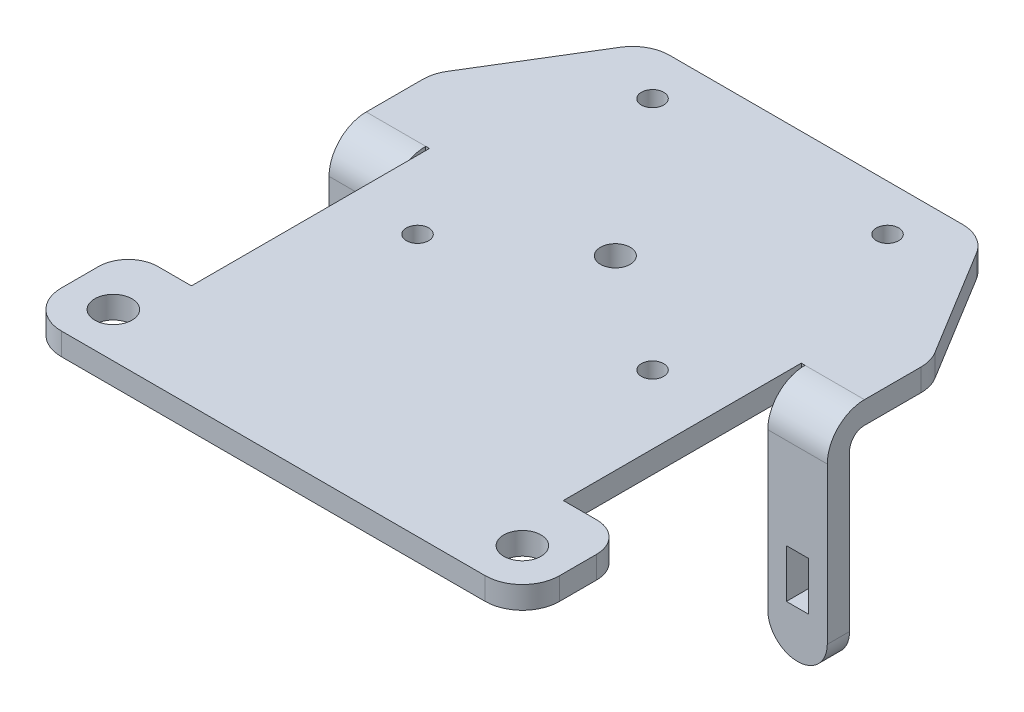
ISO-10303-21;
HEADER;
FILE_DESCRIPTION(('STEP AP214'),'2;1');
FILE_NAME('part.step','',(''),(''),'','','');
FILE_SCHEMA(('AUTOMOTIVE_DESIGN { 1 0 10303 214 1 1 1 1 }'));
ENDSEC;
DATA;
#1=APPLICATION_CONTEXT('core data for automotive mechanical design processes');
#2=APPLICATION_PROTOCOL_DEFINITION('international standard','automotive_design',2000,#1);
#3=PRODUCT_CONTEXT('',#1,'mechanical');
#4=PRODUCT('Part','Part','',(#3));
#5=PRODUCT_RELATED_PRODUCT_CATEGORY('part','',(#4));
#6=PRODUCT_DEFINITION_FORMATION('','',#4);
#7=PRODUCT_DEFINITION_CONTEXT('part definition',#1,'design');
#8=PRODUCT_DEFINITION('design','',#6,#7);
#9=PRODUCT_DEFINITION_SHAPE('','',#8);
#10=(LENGTH_UNIT() NAMED_UNIT(*) SI_UNIT(.MILLI.,.METRE.));
#11=(NAMED_UNIT(*) PLANE_ANGLE_UNIT() SI_UNIT($,.RADIAN.));
#12=(NAMED_UNIT(*) SI_UNIT($,.STERADIAN.) SOLID_ANGLE_UNIT());
#13=UNCERTAINTY_MEASURE_WITH_UNIT(LENGTH_MEASURE(1.E-05),#10,'distance_accuracy_value','');
#14=(GEOMETRIC_REPRESENTATION_CONTEXT(3) GLOBAL_UNCERTAINTY_ASSIGNED_CONTEXT((#13)) GLOBAL_UNIT_ASSIGNED_CONTEXT((#10,
#11,#12)) REPRESENTATION_CONTEXT('',''));
#15=CARTESIAN_POINT('',(0.,0.,0.));
#16=DIRECTION('',(0.,0.,1.));
#17=DIRECTION('',(1.,0.,0.));
#18=AXIS2_PLACEMENT_3D('',#15,#16,#17);
#19=CARTESIAN_POINT('',(0.,0.,-15.));
#20=DIRECTION('',(0.,0.,-1.));
#21=DIRECTION('',(0.,1.,0.));
#22=AXIS2_PLACEMENT_3D('',#19,#20,#21);
#23=PLANE('',#22);
#24=DIRECTION('',(0.,1.,0.));
#25=VECTOR('',#24,1.);
#26=CARTESIAN_POINT('',(31.,-20.75,-15.));
#27=LINE('',#26,#25);
#28=CARTESIAN_POINT('',(31.,-14.25,-15.));
#29=VERTEX_POINT('',#28);
#30=CARTESIAN_POINT('',(31.,-20.75,-15.));
#31=VERTEX_POINT('',#30);
#32=EDGE_CURVE('E225',#29,#31,#27,.F.);
#33=ORIENTED_EDGE('',*,*,#32,.T.);
#34=DIRECTION('',(1.,0.,0.));
#35=VECTOR('',#34,1.);
#36=CARTESIAN_POINT('',(31.,-20.75,-15.));
#37=LINE('',#36,#35);
#38=CARTESIAN_POINT('',(28.,-20.75,-15.));
#39=VERTEX_POINT('',#38);
#40=EDGE_CURVE('E292',#31,#39,#37,.F.);
#41=ORIENTED_EDGE('',*,*,#40,.T.);
#42=DIRECTION('',(0.,1.,0.));
#43=VECTOR('',#42,1.);
#44=CARTESIAN_POINT('',(28.,-20.75,-15.));
#45=LINE('',#44,#43);
#46=CARTESIAN_POINT('',(28.,-14.25,-15.));
#47=VERTEX_POINT('',#46);
#48=EDGE_CURVE('E311',#39,#47,#45,.T.);
#49=ORIENTED_EDGE('',*,*,#48,.T.);
#50=DIRECTION('',(1.,0.,0.));
#51=VECTOR('',#50,1.);
#52=CARTESIAN_POINT('',(31.,-14.25,-15.));
#53=LINE('',#52,#51);
#54=EDGE_CURVE('E293',#47,#29,#53,.T.);
#55=ORIENTED_EDGE('',*,*,#54,.T.);
#56=EDGE_LOOP('',(#33,#41,#49,#55));
#57=FACE_BOUND('',#56,.T.);
#58=CARTESIAN_POINT('',(29.5,-23.,-15.));
#59=DIRECTION('',(0.,0.,-1.));
#60=DIRECTION('',(0.,1.,0.));
#61=AXIS2_PLACEMENT_3D('',#58,#59,#60);
#62=CIRCLE('',#61,4.);
#63=CARTESIAN_POINT('',(33.5,-23.,-15.));
#64=VERTEX_POINT('',#63);
#65=CARTESIAN_POINT('',(25.5,-23.,-15.));
#66=VERTEX_POINT('',#65);
#67=EDGE_CURVE('E20',#64,#66,#62,.T.);
#68=ORIENTED_EDGE('',*,*,#67,.F.);
#69=DIRECTION('',(0.,1.,0.));
#70=VECTOR('',#69,1.);
#71=CARTESIAN_POINT('',(33.5,0.,-15.));
#72=LINE('',#71,#70);
#73=CARTESIAN_POINT('',(33.5,-1.99999999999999,-15.));
#74=VERTEX_POINT('',#73);
#75=EDGE_CURVE('E325',#74,#64,#72,.F.);
#76=ORIENTED_EDGE('',*,*,#75,.F.);
#77=DIRECTION('',(-1.,0.,0.));
#78=VECTOR('',#77,1.);
#79=CARTESIAN_POINT('',(25.5,-2.,-15.));
#80=LINE('',#79,#78);
#81=CARTESIAN_POINT('',(25.5,-2.,-15.));
#82=VERTEX_POINT('',#81);
#83=EDGE_CURVE('E497',#82,#74,#80,.F.);
#84=ORIENTED_EDGE('',*,*,#83,.F.);
#85=DIRECTION('',(0.,-1.,0.));
#86=VECTOR('',#85,1.);
#87=CARTESIAN_POINT('',(25.5,-27.,-15.));
#88=LINE('',#87,#86);
#89=EDGE_CURVE('E294',#66,#82,#88,.F.);
#90=ORIENTED_EDGE('',*,*,#89,.F.);
#91=EDGE_LOOP('',(#68,#76,#84,#90));
#92=FACE_BOUND('',#91,.T.);
#93=ADVANCED_FACE('F17',(#57,#92),#23,.F.);
#94=CARTESIAN_POINT('',(0.,0.,-15.));
#95=DIRECTION('',(0.,0.,1.));
#96=DIRECTION('',(0.,-1.,0.));
#97=AXIS2_PLACEMENT_3D('',#94,#95,#96);
#98=PLANE('',#97);
#99=DIRECTION('',(0.,1.,0.));
#100=VECTOR('',#99,1.);
#101=CARTESIAN_POINT('',(-31.,-20.75,-15.));
#102=LINE('',#101,#100);
#103=CARTESIAN_POINT('',(-31.,-20.75,-15.));
#104=VERTEX_POINT('',#103);
#105=CARTESIAN_POINT('',(-31.,-14.25,-15.));
#106=VERTEX_POINT('',#105);
#107=EDGE_CURVE('E481',#104,#106,#102,.T.);
#108=ORIENTED_EDGE('',*,*,#107,.T.);
#109=DIRECTION('',(1.,0.,0.));
#110=VECTOR('',#109,1.);
#111=CARTESIAN_POINT('',(-31.,-14.25,-15.));
#112=LINE('',#111,#110);
#113=CARTESIAN_POINT('',(-28.,-14.25,-15.));
#114=VERTEX_POINT('',#113);
#115=EDGE_CURVE('E550',#106,#114,#112,.T.);
#116=ORIENTED_EDGE('',*,*,#115,.T.);
#117=DIRECTION('',(0.,1.,0.));
#118=VECTOR('',#117,1.);
#119=CARTESIAN_POINT('',(-28.,-20.75,-15.));
#120=LINE('',#119,#118);
#121=CARTESIAN_POINT('',(-28.,-20.75,-15.));
#122=VERTEX_POINT('',#121);
#123=EDGE_CURVE('E545',#114,#122,#120,.F.);
#124=ORIENTED_EDGE('',*,*,#123,.T.);
#125=DIRECTION('',(1.,0.,0.));
#126=VECTOR('',#125,1.);
#127=CARTESIAN_POINT('',(-31.,-20.75,-15.));
#128=LINE('',#127,#126);
#129=EDGE_CURVE('E539',#122,#104,#128,.F.);
#130=ORIENTED_EDGE('',*,*,#129,.T.);
#131=EDGE_LOOP('',(#108,#116,#124,#130));
#132=FACE_BOUND('',#131,.T.);
#133=DIRECTION('',(0.,1.,0.));
#134=VECTOR('',#133,1.);
#135=CARTESIAN_POINT('',(-25.5,-27.,-15.));
#136=LINE('',#135,#134);
#137=CARTESIAN_POINT('',(-25.5,-1.99999999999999,-15.));
#138=VERTEX_POINT('',#137);
#139=CARTESIAN_POINT('',(-25.5,-23.,-15.));
#140=VERTEX_POINT('',#139);
#141=EDGE_CURVE('E498',#138,#140,#136,.F.);
#142=ORIENTED_EDGE('',*,*,#141,.F.);
#143=DIRECTION('',(-1.,0.,0.));
#144=VECTOR('',#143,1.);
#145=CARTESIAN_POINT('',(-33.5,-2.,-15.));
#146=LINE('',#145,#144);
#147=CARTESIAN_POINT('',(-33.5,-2.,-15.));
#148=VERTEX_POINT('',#147);
#149=EDGE_CURVE('E501',#148,#138,#146,.F.);
#150=ORIENTED_EDGE('',*,*,#149,.F.);
#151=DIRECTION('',(0.,1.,0.));
#152=VECTOR('',#151,1.);
#153=CARTESIAN_POINT('',(-33.5,0.,-15.));
#154=LINE('',#153,#152);
#155=CARTESIAN_POINT('',(-33.5,-23.,-15.));
#156=VERTEX_POINT('',#155);
#157=EDGE_CURVE('E324',#156,#148,#154,.T.);
#158=ORIENTED_EDGE('',*,*,#157,.F.);
#159=CARTESIAN_POINT('',(-29.5,-23.,-15.));
#160=DIRECTION('',(0.,0.,-1.));
#161=DIRECTION('',(0.,1.,0.));
#162=AXIS2_PLACEMENT_3D('',#159,#160,#161);
#163=CIRCLE('',#162,4.);
#164=EDGE_CURVE('E480',#140,#156,#163,.T.);
#165=ORIENTED_EDGE('',*,*,#164,.F.);
#166=EDGE_LOOP('',(#142,#150,#158,#165));
#167=FACE_BOUND('',#166,.T.);
#168=ADVANCED_FACE('F658',(#132,#167),#98,.T.);
#169=CARTESIAN_POINT('',(29.5,-23.,-15.));
#170=DIRECTION('',(0.,0.,-1.));
#171=DIRECTION('',(0.,1.,0.));
#172=AXIS2_PLACEMENT_3D('',#169,#170,#171);
#173=CYLINDRICAL_SURFACE('',#172,4.);
#174=DIRECTION('',(0.,0.,1.));
#175=VECTOR('',#174,1.);
#176=CARTESIAN_POINT('',(25.5,-23.,-15.));
#177=LINE('',#176,#175);
#178=CARTESIAN_POINT('',(25.5,-23.,-18.));
#179=VERTEX_POINT('',#178);
#180=EDGE_CURVE('E319',#179,#66,#177,.T.);
#181=ORIENTED_EDGE('',*,*,#180,.F.);
#182=CARTESIAN_POINT('',(29.5,-23.,-18.));
#183=DIRECTION('',(0.,0.,-1.));
#184=DIRECTION('',(0.,1.,0.));
#185=AXIS2_PLACEMENT_3D('',#182,#183,#184);
#186=CIRCLE('',#185,4.);
#187=CARTESIAN_POINT('',(33.5,-23.,-18.));
#188=VERTEX_POINT('',#187);
#189=EDGE_CURVE('E473',#188,#179,#186,.T.);
#190=ORIENTED_EDGE('',*,*,#189,.F.);
#191=DIRECTION('',(0.,0.,-1.));
#192=VECTOR('',#191,1.);
#193=CARTESIAN_POINT('',(33.5,-23.,-15.));
#194=LINE('',#193,#192);
#195=EDGE_CURVE('E321',#64,#188,#194,.T.);
#196=ORIENTED_EDGE('',*,*,#195,.F.);
#197=ORIENTED_EDGE('',*,*,#67,.T.);
#198=EDGE_LOOP('',(#181,#190,#196,#197));
#199=FACE_BOUND('',#198,.T.);
#200=ADVANCED_FACE('F661',(#199),#173,.T.);
#201=CARTESIAN_POINT('',(31.,-20.75,-25.));
#202=DIRECTION('',(1.,0.,0.));
#203=DIRECTION('',(0.,0.,-1.));
#204=AXIS2_PLACEMENT_3D('',#201,#202,#203);
#205=PLANE('',#204);
#206=DIRECTION('',(0.,0.,-1.));
#207=VECTOR('',#206,1.);
#208=CARTESIAN_POINT('',(31.,-20.75,-25.));
#209=LINE('',#208,#207);
#210=CARTESIAN_POINT('',(31.,-20.75,-18.));
#211=VERTEX_POINT('',#210);
#212=EDGE_CURVE('E300',#211,#31,#209,.F.);
#213=ORIENTED_EDGE('',*,*,#212,.T.);
#214=ORIENTED_EDGE('',*,*,#32,.F.);
#215=DIRECTION('',(0.,0.,1.));
#216=VECTOR('',#215,1.);
#217=CARTESIAN_POINT('',(31.,-14.25,-25.));
#218=LINE('',#217,#216);
#219=CARTESIAN_POINT('',(31.,-14.25,-18.));
#220=VERTEX_POINT('',#219);
#221=EDGE_CURVE('E316',#29,#220,#218,.F.);
#222=ORIENTED_EDGE('',*,*,#221,.T.);
#223=DIRECTION('',(0.,1.,0.));
#224=VECTOR('',#223,1.);
#225=CARTESIAN_POINT('',(31.,0.,-18.));
#226=LINE('',#225,#224);
#227=EDGE_CURVE('E307',#211,#220,#226,.T.);
#228=ORIENTED_EDGE('',*,*,#227,.F.);
#229=EDGE_LOOP('',(#213,#214,#222,#228));
#230=FACE_BOUND('',#229,.T.);
#231=ADVANCED_FACE('F306',(#230),#205,.F.);
#232=CARTESIAN_POINT('',(31.,-14.25,-25.));
#233=DIRECTION('',(0.,1.,0.));
#234=DIRECTION('',(0.,0.,1.));
#235=AXIS2_PLACEMENT_3D('',#232,#233,#234);
#236=PLANE('',#235);
#237=ORIENTED_EDGE('',*,*,#221,.F.);
#238=ORIENTED_EDGE('',*,*,#54,.F.);
#239=DIRECTION('',(0.,0.,1.));
#240=VECTOR('',#239,1.);
#241=CARTESIAN_POINT('',(28.,-14.25,-25.));
#242=LINE('',#241,#240);
#243=CARTESIAN_POINT('',(28.,-14.25,-18.));
#244=VERTEX_POINT('',#243);
#245=EDGE_CURVE('E308',#47,#244,#242,.F.);
#246=ORIENTED_EDGE('',*,*,#245,.T.);
#247=DIRECTION('',(1.,0.,0.));
#248=VECTOR('',#247,1.);
#249=CARTESIAN_POINT('',(0.,-14.25,-18.));
#250=LINE('',#249,#248);
#251=EDGE_CURVE('E510',#220,#244,#250,.F.);
#252=ORIENTED_EDGE('',*,*,#251,.F.);
#253=EDGE_LOOP('',(#237,#238,#246,#252));
#254=FACE_BOUND('',#253,.T.);
#255=ADVANCED_FACE('F914',(#254),#236,.F.);
#256=CARTESIAN_POINT('',(28.,-20.75,-25.));
#257=DIRECTION('',(-1.,0.,0.));
#258=DIRECTION('',(0.,0.,1.));
#259=AXIS2_PLACEMENT_3D('',#256,#257,#258);
#260=PLANE('',#259);
#261=ORIENTED_EDGE('',*,*,#245,.F.);
#262=ORIENTED_EDGE('',*,*,#48,.F.);
#263=DIRECTION('',(0.,0.,-1.));
#264=VECTOR('',#263,1.);
#265=CARTESIAN_POINT('',(28.,-20.75,-25.));
#266=LINE('',#265,#264);
#267=CARTESIAN_POINT('',(28.,-20.75,-18.));
#268=VERTEX_POINT('',#267);
#269=EDGE_CURVE('E303',#39,#268,#266,.T.);
#270=ORIENTED_EDGE('',*,*,#269,.T.);
#271=DIRECTION('',(0.,1.,0.));
#272=VECTOR('',#271,1.);
#273=CARTESIAN_POINT('',(28.,0.,-18.));
#274=LINE('',#273,#272);
#275=EDGE_CURVE('E507',#244,#268,#274,.F.);
#276=ORIENTED_EDGE('',*,*,#275,.F.);
#277=EDGE_LOOP('',(#261,#262,#270,#276));
#278=FACE_BOUND('',#277,.T.);
#279=ADVANCED_FACE('F506',(#278),#260,.F.);
#280=CARTESIAN_POINT('',(31.,-20.75,-25.));
#281=DIRECTION('',(0.,-1.,0.));
#282=DIRECTION('',(0.,0.,-1.));
#283=AXIS2_PLACEMENT_3D('',#280,#281,#282);
#284=PLANE('',#283);
#285=ORIENTED_EDGE('',*,*,#269,.F.);
#286=ORIENTED_EDGE('',*,*,#40,.F.);
#287=ORIENTED_EDGE('',*,*,#212,.F.);
#288=DIRECTION('',(1.,0.,0.));
#289=VECTOR('',#288,1.);
#290=CARTESIAN_POINT('',(0.,-20.75,-17.9999999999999));
#291=LINE('',#290,#289);
#292=EDGE_CURVE('E472',#268,#211,#291,.T.);
#293=ORIENTED_EDGE('',*,*,#292,.F.);
#294=EDGE_LOOP('',(#285,#286,#287,#293));
#295=FACE_BOUND('',#294,.T.);
#296=ADVANCED_FACE('F298',(#295),#284,.F.);
#297=CARTESIAN_POINT('',(-29.5,-23.,-15.));
#298=DIRECTION('',(0.,0.,-1.));
#299=DIRECTION('',(0.,1.,0.));
#300=AXIS2_PLACEMENT_3D('',#297,#298,#299);
#301=CYLINDRICAL_SURFACE('',#300,4.);
#302=ORIENTED_EDGE('',*,*,#164,.T.);
#303=DIRECTION('',(0.,0.,-1.));
#304=VECTOR('',#303,1.);
#305=CARTESIAN_POINT('',(-33.5,-23.,-15.));
#306=LINE('',#305,#304);
#307=CARTESIAN_POINT('',(-33.5,-23.,-18.));
#308=VERTEX_POINT('',#307);
#309=EDGE_CURVE('E482',#156,#308,#306,.T.);
#310=ORIENTED_EDGE('',*,*,#309,.T.);
#311=CARTESIAN_POINT('',(-29.5,-23.,-18.));
#312=DIRECTION('',(0.,0.,-1.));
#313=DIRECTION('',(0.,1.,0.));
#314=AXIS2_PLACEMENT_3D('',#311,#312,#313);
#315=CIRCLE('',#314,4.);
#316=CARTESIAN_POINT('',(-25.5,-23.,-18.));
#317=VERTEX_POINT('',#316);
#318=EDGE_CURVE('E460',#308,#317,#315,.F.);
#319=ORIENTED_EDGE('',*,*,#318,.T.);
#320=DIRECTION('',(0.,0.,1.));
#321=VECTOR('',#320,1.);
#322=CARTESIAN_POINT('',(-25.5,-23.,-15.));
#323=LINE('',#322,#321);
#324=EDGE_CURVE('E496',#140,#317,#323,.F.);
#325=ORIENTED_EDGE('',*,*,#324,.F.);
#326=EDGE_LOOP('',(#302,#310,#319,#325));
#327=FACE_BOUND('',#326,.T.);
#328=ADVANCED_FACE('F907',(#327),#301,.T.);
#329=CARTESIAN_POINT('',(-31.,-20.75,-25.));
#330=DIRECTION('',(-1.,0.,0.));
#331=DIRECTION('',(0.,0.,1.));
#332=AXIS2_PLACEMENT_3D('',#329,#330,#331);
#333=PLANE('',#332);
#334=ORIENTED_EDGE('',*,*,#107,.F.);
#335=DIRECTION('',(0.,0.,-1.));
#336=VECTOR('',#335,1.);
#337=CARTESIAN_POINT('',(-31.,-20.75,-25.));
#338=LINE('',#337,#336);
#339=CARTESIAN_POINT('',(-31.,-20.75,-18.));
#340=VERTEX_POINT('',#339);
#341=EDGE_CURVE('E536',#104,#340,#338,.T.);
#342=ORIENTED_EDGE('',*,*,#341,.T.);
#343=DIRECTION('',(0.,-1.,0.));
#344=VECTOR('',#343,1.);
#345=CARTESIAN_POINT('',(-31.,0.,-18.));
#346=LINE('',#345,#344);
#347=CARTESIAN_POINT('',(-31.,-14.25,-18.));
#348=VERTEX_POINT('',#347);
#349=EDGE_CURVE('E463',#340,#348,#346,.F.);
#350=ORIENTED_EDGE('',*,*,#349,.T.);
#351=DIRECTION('',(0.,0.,1.));
#352=VECTOR('',#351,1.);
#353=CARTESIAN_POINT('',(-31.,-14.25,-25.));
#354=LINE('',#353,#352);
#355=EDGE_CURVE('E488',#348,#106,#354,.T.);
#356=ORIENTED_EDGE('',*,*,#355,.T.);
#357=EDGE_LOOP('',(#334,#342,#350,#356));
#358=FACE_BOUND('',#357,.T.);
#359=ADVANCED_FACE('F554',(#358),#333,.F.);
#360=CARTESIAN_POINT('',(-31.,-14.25,-25.));
#361=DIRECTION('',(0.,1.,0.));
#362=DIRECTION('',(0.,0.,1.));
#363=AXIS2_PLACEMENT_3D('',#360,#361,#362);
#364=PLANE('',#363);
#365=ORIENTED_EDGE('',*,*,#115,.F.);
#366=ORIENTED_EDGE('',*,*,#355,.F.);
#367=DIRECTION('',(1.,0.,0.));
#368=VECTOR('',#367,1.);
#369=CARTESIAN_POINT('',(0.,-14.25,-18.));
#370=LINE('',#369,#368);
#371=CARTESIAN_POINT('',(-28.,-14.25,-18.));
#372=VERTEX_POINT('',#371);
#373=EDGE_CURVE('E561',#348,#372,#370,.T.);
#374=ORIENTED_EDGE('',*,*,#373,.T.);
#375=DIRECTION('',(0.,0.,-1.));
#376=VECTOR('',#375,1.);
#377=CARTESIAN_POINT('',(-28.,-14.25,-25.));
#378=LINE('',#377,#376);
#379=EDGE_CURVE('E547',#372,#114,#378,.F.);
#380=ORIENTED_EDGE('',*,*,#379,.T.);
#381=EDGE_LOOP('',(#365,#366,#374,#380));
#382=FACE_BOUND('',#381,.T.);
#383=ADVANCED_FACE('F560',(#382),#364,.F.);
#384=CARTESIAN_POINT('',(-28.,-20.75,-25.));
#385=DIRECTION('',(1.,0.,0.));
#386=DIRECTION('',(0.,0.,-1.));
#387=AXIS2_PLACEMENT_3D('',#384,#385,#386);
#388=PLANE('',#387);
#389=ORIENTED_EDGE('',*,*,#123,.F.);
#390=ORIENTED_EDGE('',*,*,#379,.F.);
#391=DIRECTION('',(0.,-1.,0.));
#392=VECTOR('',#391,1.);
#393=CARTESIAN_POINT('',(-28.,0.,-18.));
#394=LINE('',#393,#392);
#395=CARTESIAN_POINT('',(-28.,-20.75,-18.));
#396=VERTEX_POINT('',#395);
#397=EDGE_CURVE('E568',#372,#396,#394,.T.);
#398=ORIENTED_EDGE('',*,*,#397,.T.);
#399=DIRECTION('',(0.,0.,-1.));
#400=VECTOR('',#399,1.);
#401=CARTESIAN_POINT('',(-28.,-20.75,-25.));
#402=LINE('',#401,#400);
#403=EDGE_CURVE('E542',#396,#122,#402,.F.);
#404=ORIENTED_EDGE('',*,*,#403,.T.);
#405=EDGE_LOOP('',(#389,#390,#398,#404));
#406=FACE_BOUND('',#405,.T.);
#407=ADVANCED_FACE('F656',(#406),#388,.F.);
#408=CARTESIAN_POINT('',(-31.,-20.75,-25.));
#409=DIRECTION('',(0.,-1.,0.));
#410=DIRECTION('',(0.,0.,-1.));
#411=AXIS2_PLACEMENT_3D('',#408,#409,#410);
#412=PLANE('',#411);
#413=ORIENTED_EDGE('',*,*,#129,.F.);
#414=ORIENTED_EDGE('',*,*,#403,.F.);
#415=DIRECTION('',(1.,0.,0.));
#416=VECTOR('',#415,1.);
#417=CARTESIAN_POINT('',(0.,-20.75,-17.9999999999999));
#418=LINE('',#417,#416);
#419=EDGE_CURVE('E459',#396,#340,#418,.F.);
#420=ORIENTED_EDGE('',*,*,#419,.T.);
#421=ORIENTED_EDGE('',*,*,#341,.F.);
#422=EDGE_LOOP('',(#413,#414,#420,#421));
#423=FACE_BOUND('',#422,.T.);
#424=ADVANCED_FACE('F653',(#423),#412,.F.);
#425=CARTESIAN_POINT('',(25.5,-2.,-20.));
#426=DIRECTION('',(-1.,0.,0.));
#427=DIRECTION('',(0.,-1.,0.));
#428=AXIS2_PLACEMENT_3D('',#425,#426,#427);
#429=CYLINDRICAL_SURFACE('',#428,5.);
#430=ORIENTED_EDGE('',*,*,#83,.T.);
#431=CARTESIAN_POINT('',(33.5,-2.,-20.));
#432=DIRECTION('',(-1.,0.,0.));
#433=DIRECTION('',(0.,-1.,0.));
#434=AXIS2_PLACEMENT_3D('',#431,#432,#433);
#435=CIRCLE('',#434,5.);
#436=CARTESIAN_POINT('',(33.5,3.,-20.));
#437=VERTEX_POINT('',#436);
#438=EDGE_CURVE('E469',#437,#74,#435,.F.);
#439=ORIENTED_EDGE('',*,*,#438,.F.);
#440=DIRECTION('',(1.,0.,0.));
#441=VECTOR('',#440,1.);
#442=CARTESIAN_POINT('',(0.,3.,-20.));
#443=LINE('',#442,#441);
#444=CARTESIAN_POINT('',(25.5,3.,-20.));
#445=VERTEX_POINT('',#444);
#446=EDGE_CURVE('E528',#445,#437,#443,.T.);
#447=ORIENTED_EDGE('',*,*,#446,.F.);
#448=CARTESIAN_POINT('',(25.5,-2.,-20.));
#449=DIRECTION('',(-1.,0.,0.));
#450=DIRECTION('',(0.,-1.,0.));
#451=AXIS2_PLACEMENT_3D('',#448,#449,#450);
#452=CIRCLE('',#451,5.);
#453=EDGE_CURVE('E477',#445,#82,#452,.F.);
#454=ORIENTED_EDGE('',*,*,#453,.T.);
#455=EDGE_LOOP('',(#430,#439,#447,#454));
#456=FACE_BOUND('',#455,.T.);
#457=ADVANCED_FACE('F598',(#456),#429,.T.);
#458=CARTESIAN_POINT('',(-33.5,-2.,-20.));
#459=DIRECTION('',(-1.,0.,0.));
#460=DIRECTION('',(0.,0.,1.));
#461=AXIS2_PLACEMENT_3D('',#458,#459,#460);
#462=CYLINDRICAL_SURFACE('',#461,5.);
#463=ORIENTED_EDGE('',*,*,#149,.T.);
#464=CARTESIAN_POINT('',(-25.5,-2.,-20.));
#465=DIRECTION('',(-1.,0.,0.));
#466=DIRECTION('',(0.,0.,1.));
#467=AXIS2_PLACEMENT_3D('',#464,#465,#466);
#468=CIRCLE('',#467,5.);
#469=CARTESIAN_POINT('',(-25.5,3.,-20.));
#470=VERTEX_POINT('',#469);
#471=EDGE_CURVE('E455',#470,#138,#468,.F.);
#472=ORIENTED_EDGE('',*,*,#471,.F.);
#473=DIRECTION('',(1.,0.,0.));
#474=VECTOR('',#473,1.);
#475=CARTESIAN_POINT('',(0.,3.,-20.));
#476=LINE('',#475,#474);
#477=CARTESIAN_POINT('',(-33.5,3.,-20.));
#478=VERTEX_POINT('',#477);
#479=EDGE_CURVE('E578',#478,#470,#476,.T.);
#480=ORIENTED_EDGE('',*,*,#479,.F.);
#481=CARTESIAN_POINT('',(-33.5,-2.,-20.));
#482=DIRECTION('',(-1.,0.,0.));
#483=DIRECTION('',(0.,0.,1.));
#484=AXIS2_PLACEMENT_3D('',#481,#482,#483);
#485=CIRCLE('',#484,5.);
#486=EDGE_CURVE('E465',#478,#148,#485,.F.);
#487=ORIENTED_EDGE('',*,*,#486,.T.);
#488=EDGE_LOOP('',(#463,#472,#480,#487));
#489=FACE_BOUND('',#488,.T.);
#490=ADVANCED_FACE('F669',(#489),#462,.T.);
#491=CARTESIAN_POINT('',(33.5,3.,-20.));
#492=DIRECTION('',(0.,0.,-1.));
#493=DIRECTION('',(-1.,0.,0.));
#494=AXIS2_PLACEMENT_3D('',#491,#492,#493);
#495=PLANE('',#494);
#496=DIRECTION('',(0.,1.,0.));
#497=VECTOR('',#496,1.);
#498=CARTESIAN_POINT('',(25.5,-2.,-20.));
#499=LINE('',#498,#497);
#500=CARTESIAN_POINT('',(25.5,0.,-20.));
#501=VERTEX_POINT('',#500);
#502=EDGE_CURVE('E479',#501,#445,#499,.T.);
#503=ORIENTED_EDGE('',*,*,#502,.T.);
#504=DIRECTION('',(1.,0.,0.));
#505=VECTOR('',#504,1.);
#506=CARTESIAN_POINT('',(0.,3.,-20.));
#507=LINE('',#506,#505);
#508=CARTESIAN_POINT('',(25.,3.,-20.));
#509=VERTEX_POINT('',#508);
#510=EDGE_CURVE('E525',#509,#445,#507,.T.);
#511=ORIENTED_EDGE('',*,*,#510,.F.);
#512=DIRECTION('',(0.,1.,0.));
#513=VECTOR('',#512,1.);
#514=CARTESIAN_POINT('',(25.,3.,-20.));
#515=LINE('',#514,#513);
#516=CARTESIAN_POINT('',(25.,0.,-20.));
#517=VERTEX_POINT('',#516);
#518=EDGE_CURVE('E454',#509,#517,#515,.F.);
#519=ORIENTED_EDGE('',*,*,#518,.T.);
#520=DIRECTION('',(-1.,0.,0.));
#521=VECTOR('',#520,1.);
#522=CARTESIAN_POINT('',(33.5,0.,-20.));
#523=LINE('',#522,#521);
#524=EDGE_CURVE('E235',#501,#517,#523,.T.);
#525=ORIENTED_EDGE('',*,*,#524,.F.);
#526=EDGE_LOOP('',(#503,#511,#519,#525));
#527=FACE_BOUND('',#526,.T.);
#528=ADVANCED_FACE('F779',(#527),#495,.F.);
#529=CARTESIAN_POINT('',(25.5,-2.,-20.));
#530=DIRECTION('',(1.,0.,0.));
#531=DIRECTION('',(0.,1.,0.));
#532=AXIS2_PLACEMENT_3D('',#529,#530,#531);
#533=PLANE('',#532);
#534=CARTESIAN_POINT('',(25.5,-2.,-20.));
#535=DIRECTION('',(-1.,0.,0.));
#536=DIRECTION('',(0.,-1.,0.));
#537=AXIS2_PLACEMENT_3D('',#534,#535,#536);
#538=CIRCLE('',#537,2.);
#539=CARTESIAN_POINT('',(25.5,-2.,-18.));
#540=VERTEX_POINT('',#539);
#541=EDGE_CURVE('E451',#501,#540,#538,.F.);
#542=ORIENTED_EDGE('',*,*,#541,.T.);
#543=DIRECTION('',(0.,1.,0.));
#544=VECTOR('',#543,1.);
#545=CARTESIAN_POINT('',(25.5,0.,-18.));
#546=LINE('',#545,#544);
#547=EDGE_CURVE('E475',#179,#540,#546,.T.);
#548=ORIENTED_EDGE('',*,*,#547,.F.);
#549=ORIENTED_EDGE('',*,*,#180,.T.);
#550=ORIENTED_EDGE('',*,*,#89,.T.);
#551=ORIENTED_EDGE('',*,*,#453,.F.);
#552=ORIENTED_EDGE('',*,*,#502,.F.);
#553=EDGE_LOOP('',(#542,#548,#549,#550,#551,#552));
#554=FACE_BOUND('',#553,.T.);
#555=ADVANCED_FACE('F777',(#554),#533,.F.);
#556=CARTESIAN_POINT('',(0.,0.,-18.));
#557=DIRECTION('',(0.,0.,-1.));
#558=DIRECTION('',(0.,1.,0.));
#559=AXIS2_PLACEMENT_3D('',#556,#557,#558);
#560=PLANE('',#559);
#561=ORIENTED_EDGE('',*,*,#275,.T.);
#562=ORIENTED_EDGE('',*,*,#292,.T.);
#563=ORIENTED_EDGE('',*,*,#227,.T.);
#564=ORIENTED_EDGE('',*,*,#251,.T.);
#565=EDGE_LOOP('',(#561,#562,#563,#564));
#566=FACE_BOUND('',#565,.T.);
#567=ORIENTED_EDGE('',*,*,#547,.T.);
#568=DIRECTION('',(-1.,0.,0.));
#569=VECTOR('',#568,1.);
#570=CARTESIAN_POINT('',(25.5,-2.,-18.));
#571=LINE('',#570,#569);
#572=CARTESIAN_POINT('',(33.5,-1.99999999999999,-18.));
#573=VERTEX_POINT('',#572);
#574=EDGE_CURVE('E450',#540,#573,#571,.F.);
#575=ORIENTED_EDGE('',*,*,#574,.T.);
#576=DIRECTION('',(0.,1.,0.));
#577=VECTOR('',#576,1.);
#578=CARTESIAN_POINT('',(33.5,0.,-18.));
#579=LINE('',#578,#577);
#580=EDGE_CURVE('E476',#573,#188,#579,.F.);
#581=ORIENTED_EDGE('',*,*,#580,.T.);
#582=ORIENTED_EDGE('',*,*,#189,.T.);
#583=EDGE_LOOP('',(#567,#575,#581,#582));
#584=FACE_BOUND('',#583,.T.);
#585=ADVANCED_FACE('F888',(#566,#584),#560,.T.);
#586=CARTESIAN_POINT('',(0.,0.,-18.));
#587=DIRECTION('',(0.,0.,1.));
#588=DIRECTION('',(0.,-1.,0.));
#589=AXIS2_PLACEMENT_3D('',#586,#587,#588);
#590=PLANE('',#589);
#591=ORIENTED_EDGE('',*,*,#397,.F.);
#592=ORIENTED_EDGE('',*,*,#373,.F.);
#593=ORIENTED_EDGE('',*,*,#349,.F.);
#594=ORIENTED_EDGE('',*,*,#419,.F.);
#595=EDGE_LOOP('',(#591,#592,#593,#594));
#596=FACE_BOUND('',#595,.T.);
#597=ORIENTED_EDGE('',*,*,#318,.F.);
#598=DIRECTION('',(0.,-1.,0.));
#599=VECTOR('',#598,1.);
#600=CARTESIAN_POINT('',(-33.5,0.,-18.));
#601=LINE('',#600,#599);
#602=CARTESIAN_POINT('',(-33.5,-2.,-18.));
#603=VERTEX_POINT('',#602);
#604=EDGE_CURVE('E464',#603,#308,#601,.T.);
#605=ORIENTED_EDGE('',*,*,#604,.F.);
#606=DIRECTION('',(-1.,0.,0.));
#607=VECTOR('',#606,1.);
#608=CARTESIAN_POINT('',(-33.5,-2.,-18.));
#609=LINE('',#608,#607);
#610=CARTESIAN_POINT('',(-25.5,-1.99999999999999,-18.));
#611=VERTEX_POINT('',#610);
#612=EDGE_CURVE('E422',#603,#611,#609,.F.);
#613=ORIENTED_EDGE('',*,*,#612,.T.);
#614=DIRECTION('',(0.,-1.,0.));
#615=VECTOR('',#614,1.);
#616=CARTESIAN_POINT('',(-25.5,0.,-18.));
#617=LINE('',#616,#615);
#618=EDGE_CURVE('E468',#317,#611,#617,.F.);
#619=ORIENTED_EDGE('',*,*,#618,.F.);
#620=EDGE_LOOP('',(#597,#605,#613,#619));
#621=FACE_BOUND('',#620,.T.);
#622=ADVANCED_FACE('F564',(#596,#621),#590,.F.);
#623=CARTESIAN_POINT('',(-25.5,-2.,-20.));
#624=DIRECTION('',(1.,0.,0.));
#625=DIRECTION('',(0.,0.,-1.));
#626=AXIS2_PLACEMENT_3D('',#623,#624,#625);
#627=PLANE('',#626);
#628=DIRECTION('',(0.,1.,0.));
#629=VECTOR('',#628,1.);
#630=CARTESIAN_POINT('',(-25.5,3.,-20.));
#631=LINE('',#630,#629);
#632=CARTESIAN_POINT('',(-25.5,0.,-20.));
#633=VERTEX_POINT('',#632);
#634=EDGE_CURVE('E529',#633,#470,#631,.T.);
#635=ORIENTED_EDGE('',*,*,#634,.T.);
#636=ORIENTED_EDGE('',*,*,#471,.T.);
#637=ORIENTED_EDGE('',*,*,#141,.T.);
#638=ORIENTED_EDGE('',*,*,#324,.T.);
#639=ORIENTED_EDGE('',*,*,#618,.T.);
#640=CARTESIAN_POINT('',(-25.5,-2.,-20.));
#641=DIRECTION('',(-1.,0.,0.));
#642=DIRECTION('',(0.,0.,1.));
#643=AXIS2_PLACEMENT_3D('',#640,#641,#642);
#644=CIRCLE('',#643,2.);
#645=EDGE_CURVE('E418',#611,#633,#644,.T.);
#646=ORIENTED_EDGE('',*,*,#645,.T.);
#647=EDGE_LOOP('',(#635,#636,#637,#638,#639,#646));
#648=FACE_BOUND('',#647,.T.);
#649=ADVANCED_FACE('F665',(#648),#627,.T.);
#650=CARTESIAN_POINT('',(-33.5,3.,-20.));
#651=DIRECTION('',(0.,0.,-1.));
#652=DIRECTION('',(-1.,0.,0.));
#653=AXIS2_PLACEMENT_3D('',#650,#651,#652);
#654=PLANE('',#653);
#655=DIRECTION('',(-1.,0.,0.));
#656=VECTOR('',#655,1.);
#657=CARTESIAN_POINT('',(-33.5,0.,-20.));
#658=LINE('',#657,#656);
#659=CARTESIAN_POINT('',(-25.,0.,-20.));
#660=VERTEX_POINT('',#659);
#661=EDGE_CURVE('E458',#660,#633,#658,.T.);
#662=ORIENTED_EDGE('',*,*,#661,.F.);
#663=DIRECTION('',(0.,1.,0.));
#664=VECTOR('',#663,1.);
#665=CARTESIAN_POINT('',(-25.,3.,-20.));
#666=LINE('',#665,#664);
#667=CARTESIAN_POINT('',(-25.,3.,-20.));
#668=VERTEX_POINT('',#667);
#669=EDGE_CURVE('E639',#660,#668,#666,.T.);
#670=ORIENTED_EDGE('',*,*,#669,.T.);
#671=DIRECTION('',(1.,0.,0.));
#672=VECTOR('',#671,1.);
#673=CARTESIAN_POINT('',(0.,3.,-20.));
#674=LINE('',#673,#672);
#675=EDGE_CURVE('E581',#470,#668,#674,.T.);
#676=ORIENTED_EDGE('',*,*,#675,.F.);
#677=ORIENTED_EDGE('',*,*,#634,.F.);
#678=EDGE_LOOP('',(#662,#670,#676,#677));
#679=FACE_BOUND('',#678,.T.);
#680=ADVANCED_FACE('F694',(#679),#654,.F.);
#681=CARTESIAN_POINT('',(0.,3.,0.));
#682=DIRECTION('',(0.,1.,0.));
#683=DIRECTION('',(0.,0.,1.));
#684=AXIS2_PLACEMENT_3D('',#681,#682,#683);
#685=PLANE('',#684);
#686=CARTESIAN_POINT('',(-27.5,3.,20.));
#687=DIRECTION('',(0.,1.,0.));
#688=DIRECTION('',(0.,0.,1.));
#689=AXIS2_PLACEMENT_3D('',#686,#687,#688);
#690=CIRCLE('',#689,2.5);
#691=CARTESIAN_POINT('',(-27.5,3.,22.5));
#692=VERTEX_POINT('',#691);
#693=EDGE_CURVE('E378',#692,#692,#690,.F.);
#694=ORIENTED_EDGE('',*,*,#693,.T.);
#695=EDGE_LOOP('',(#694));
#696=FACE_BOUND('',#695,.T.);
#697=CARTESIAN_POINT('',(27.5,3.,20.));
#698=DIRECTION('',(0.,1.,0.));
#699=DIRECTION('',(0.,0.,1.));
#700=AXIS2_PLACEMENT_3D('',#697,#698,#699);
#701=CIRCLE('',#700,2.5);
#702=CARTESIAN_POINT('',(27.5,3.,22.5));
#703=VERTEX_POINT('',#702);
#704=EDGE_CURVE('E381',#703,#703,#701,.F.);
#705=ORIENTED_EDGE('',*,*,#704,.T.);
#706=EDGE_LOOP('',(#705));
#707=FACE_BOUND('',#706,.T.);
#708=CARTESIAN_POINT('',(-15.8,3.,-40.8));
#709=DIRECTION('',(0.,1.,0.));
#710=DIRECTION('',(0.,0.,1.));
#711=AXIS2_PLACEMENT_3D('',#708,#709,#710);
#712=CIRCLE('',#711,1.5);
#713=CARTESIAN_POINT('',(-15.8,3.,-39.3));
#714=VERTEX_POINT('',#713);
#715=EDGE_CURVE('E384',#714,#714,#712,.F.);
#716=ORIENTED_EDGE('',*,*,#715,.T.);
#717=EDGE_LOOP('',(#716));
#718=FACE_BOUND('',#717,.T.);
#719=CARTESIAN_POINT('',(15.8,3.,-40.8));
#720=DIRECTION('',(0.,1.,0.));
#721=DIRECTION('',(0.,0.,1.));
#722=AXIS2_PLACEMENT_3D('',#719,#720,#721);
#723=CIRCLE('',#722,1.5);
#724=CARTESIAN_POINT('',(15.8,3.,-39.3));
#725=VERTEX_POINT('',#724);
#726=EDGE_CURVE('E387',#725,#725,#723,.F.);
#727=ORIENTED_EDGE('',*,*,#726,.T.);
#728=EDGE_LOOP('',(#727));
#729=FACE_BOUND('',#728,.T.);
#730=CARTESIAN_POINT('',(-15.8,3.,-9.2));
#731=DIRECTION('',(0.,1.,0.));
#732=DIRECTION('',(0.,0.,1.));
#733=AXIS2_PLACEMENT_3D('',#730,#731,#732);
#734=CIRCLE('',#733,1.5);
#735=CARTESIAN_POINT('',(-15.8,3.,-7.7));
#736=VERTEX_POINT('',#735);
#737=EDGE_CURVE('E390',#736,#736,#734,.F.);
#738=ORIENTED_EDGE('',*,*,#737,.T.);
#739=EDGE_LOOP('',(#738));
#740=FACE_BOUND('',#739,.T.);
#741=CARTESIAN_POINT('',(15.8,3.,-9.2));
#742=DIRECTION('',(0.,1.,0.));
#743=DIRECTION('',(0.,0.,1.));
#744=AXIS2_PLACEMENT_3D('',#741,#742,#743);
#745=CIRCLE('',#744,1.5);
#746=CARTESIAN_POINT('',(15.8,3.,-7.7));
#747=VERTEX_POINT('',#746);
#748=EDGE_CURVE('E393',#747,#747,#745,.F.);
#749=ORIENTED_EDGE('',*,*,#748,.T.);
#750=EDGE_LOOP('',(#749));
#751=FACE_BOUND('',#750,.T.);
#752=CARTESIAN_POINT('',(0.,3.,-20.));
#753=DIRECTION('',(0.,1.,0.));
#754=DIRECTION('',(0.,0.,1.));
#755=AXIS2_PLACEMENT_3D('',#752,#753,#754);
#756=CIRCLE('',#755,2.);
#757=CARTESIAN_POINT('',(0.,3.,-18.));
#758=VERTEX_POINT('',#757);
#759=EDGE_CURVE('E396',#758,#758,#756,.F.);
#760=ORIENTED_EDGE('',*,*,#759,.T.);
#761=EDGE_LOOP('',(#760));
#762=FACE_BOUND('',#761,.T.);
#763=DIRECTION('',(1.,0.,0.));
#764=VECTOR('',#763,1.);
#765=CARTESIAN_POINT('',(0.,3.,26.));
#766=LINE('',#765,#764);
#767=CARTESIAN_POINT('',(28.5,3.,26.));
#768=VERTEX_POINT('',#767);
#769=CARTESIAN_POINT('',(-28.5,3.,26.));
#770=VERTEX_POINT('',#769);
#771=EDGE_CURVE('E627',#768,#770,#766,.F.);
#772=ORIENTED_EDGE('',*,*,#771,.F.);
#773=CARTESIAN_POINT('',(28.5,3.,21.));
#774=DIRECTION('',(0.,1.,0.));
#775=DIRECTION('',(0.,0.,1.));
#776=AXIS2_PLACEMENT_3D('',#773,#774,#775);
#777=CIRCLE('',#776,5.);
#778=CARTESIAN_POINT('',(33.5,3.,21.));
#779=VERTEX_POINT('',#778);
#780=EDGE_CURVE('E404',#779,#768,#777,.F.);
#781=ORIENTED_EDGE('',*,*,#780,.F.);
#782=DIRECTION('',(0.,0.,1.));
#783=VECTOR('',#782,1.);
#784=CARTESIAN_POINT('',(33.5,3.,0.));
#785=LINE('',#784,#783);
#786=CARTESIAN_POINT('',(33.5,3.,16.));
#787=VERTEX_POINT('',#786);
#788=EDGE_CURVE('E407',#787,#779,#785,.T.);
#789=ORIENTED_EDGE('',*,*,#788,.F.);
#790=CARTESIAN_POINT('',(29.5,3.,16.));
#791=DIRECTION('',(0.,-1.,0.));
#792=DIRECTION('',(0.,0.,-1.));
#793=AXIS2_PLACEMENT_3D('',#790,#791,#792);
#794=CIRCLE('',#793,4.);
#795=CARTESIAN_POINT('',(29.5,3.,12.));
#796=VERTEX_POINT('',#795);
#797=EDGE_CURVE('E400',#796,#787,#794,.T.);
#798=ORIENTED_EDGE('',*,*,#797,.F.);
#799=DIRECTION('',(1.,0.,0.));
#800=VECTOR('',#799,1.);
#801=CARTESIAN_POINT('',(33.5,3.,12.));
#802=LINE('',#801,#800);
#803=CARTESIAN_POINT('',(25.,3.,12.));
#804=VERTEX_POINT('',#803);
#805=EDGE_CURVE('E399',#796,#804,#802,.F.);
#806=ORIENTED_EDGE('',*,*,#805,.T.);
#807=DIRECTION('',(0.,0.,1.));
#808=VECTOR('',#807,1.);
#809=CARTESIAN_POINT('',(25.,3.,12.));
#810=LINE('',#809,#808);
#811=EDGE_CURVE('E616',#804,#509,#810,.F.);
#812=ORIENTED_EDGE('',*,*,#811,.T.);
#813=ORIENTED_EDGE('',*,*,#510,.T.);
#814=ORIENTED_EDGE('',*,*,#446,.T.);
#815=DIRECTION('',(0.,0.,1.));
#816=VECTOR('',#815,1.);
#817=CARTESIAN_POINT('',(33.5,3.,0.));
#818=LINE('',#817,#816);
#819=CARTESIAN_POINT('',(33.5,3.,-27.5931713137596));
#820=VERTEX_POINT('',#819);
#821=EDGE_CURVE('E449',#820,#437,#818,.T.);
#822=ORIENTED_EDGE('',*,*,#821,.F.);
#823=CARTESIAN_POINT('',(28.5,3.,-27.5931713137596));
#824=DIRECTION('',(0.,1.,0.));
#825=DIRECTION('',(0.,0.,1.));
#826=AXIS2_PLACEMENT_3D('',#823,#824,#825);
#827=CIRCLE('',#826,5.);
#828=CARTESIAN_POINT('',(32.7664091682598,3.,-30.2004213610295));
#829=VERTEX_POINT('',#828);
#830=EDGE_CURVE('E442',#829,#820,#827,.F.);
#831=ORIENTED_EDGE('',*,*,#830,.F.);
#832=DIRECTION('',(-0.521450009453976,0.,-0.853281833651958));
#833=VECTOR('',#832,1.);
#834=CARTESIAN_POINT('',(35.9595505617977,3.,-24.9752808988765));
#835=LINE('',#834,#833);
#836=CARTESIAN_POINT('',(23.9622360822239,3.,-44.6072500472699));
#837=VERTEX_POINT('',#836);
#838=EDGE_CURVE('E588',#837,#829,#835,.F.);
#839=ORIENTED_EDGE('',*,*,#838,.F.);
#840=CARTESIAN_POINT('',(19.6958269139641,3.,-42.));
#841=DIRECTION('',(0.,1.,0.));
#842=DIRECTION('',(0.,0.,1.));
#843=AXIS2_PLACEMENT_3D('',#840,#841,#842);
#844=CIRCLE('',#843,5.);
#845=CARTESIAN_POINT('',(19.6958269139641,3.,-47.));
#846=VERTEX_POINT('',#845);
#847=EDGE_CURVE('E437',#846,#837,#844,.F.);
#848=ORIENTED_EDGE('',*,*,#847,.F.);
#849=DIRECTION('',(-1.,0.,0.));
#850=VECTOR('',#849,1.);
#851=CARTESIAN_POINT('',(0.,3.,-47.));
#852=LINE('',#851,#850);
#853=CARTESIAN_POINT('',(-19.6958269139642,3.,-47.));
#854=VERTEX_POINT('',#853);
#855=EDGE_CURVE('E585',#854,#846,#852,.F.);
#856=ORIENTED_EDGE('',*,*,#855,.F.);
#857=CARTESIAN_POINT('',(-19.6958269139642,3.,-42.));
#858=DIRECTION('',(0.,1.,0.));
#859=DIRECTION('',(0.,0.,1.));
#860=AXIS2_PLACEMENT_3D('',#857,#858,#859);
#861=CIRCLE('',#860,5.);
#862=CARTESIAN_POINT('',(-23.962236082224,3.,-44.6072500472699));
#863=VERTEX_POINT('',#862);
#864=EDGE_CURVE('E432',#863,#854,#861,.F.);
#865=ORIENTED_EDGE('',*,*,#864,.F.);
#866=DIRECTION('',(-0.521450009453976,0.,0.853281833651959));
#867=VECTOR('',#866,1.);
#868=CARTESIAN_POINT('',(-35.9595505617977,3.,-24.9752808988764));
#869=LINE('',#868,#867);
#870=CARTESIAN_POINT('',(-32.7664091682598,3.,-30.2004213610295));
#871=VERTEX_POINT('',#870);
#872=EDGE_CURVE('E582',#871,#863,#869,.F.);
#873=ORIENTED_EDGE('',*,*,#872,.F.);
#874=CARTESIAN_POINT('',(-28.5,3.,-27.5931713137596));
#875=DIRECTION('',(0.,1.,0.));
#876=DIRECTION('',(0.,0.,1.));
#877=AXIS2_PLACEMENT_3D('',#874,#875,#876);
#878=CIRCLE('',#877,5.);
#879=CARTESIAN_POINT('',(-33.5,3.,-27.5931713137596));
#880=VERTEX_POINT('',#879);
#881=EDGE_CURVE('E427',#880,#871,#878,.F.);
#882=ORIENTED_EDGE('',*,*,#881,.F.);
#883=DIRECTION('',(0.,0.,-1.));
#884=VECTOR('',#883,1.);
#885=CARTESIAN_POINT('',(-33.5,3.,0.));
#886=LINE('',#885,#884);
#887=EDGE_CURVE('E430',#880,#478,#886,.F.);
#888=ORIENTED_EDGE('',*,*,#887,.T.);
#889=ORIENTED_EDGE('',*,*,#479,.T.);
#890=ORIENTED_EDGE('',*,*,#675,.T.);
#891=DIRECTION('',(0.,0.,-1.));
#892=VECTOR('',#891,1.);
#893=CARTESIAN_POINT('',(-25.,3.,12.));
#894=LINE('',#893,#892);
#895=CARTESIAN_POINT('',(-25.,3.,12.));
#896=VERTEX_POINT('',#895);
#897=EDGE_CURVE('E421',#668,#896,#894,.F.);
#898=ORIENTED_EDGE('',*,*,#897,.T.);
#899=DIRECTION('',(1.,0.,0.));
#900=VECTOR('',#899,1.);
#901=CARTESIAN_POINT('',(-33.5,3.,12.));
#902=LINE('',#901,#900);
#903=CARTESIAN_POINT('',(-29.5,3.,12.));
#904=VERTEX_POINT('',#903);
#905=EDGE_CURVE('E417',#896,#904,#902,.F.);
#906=ORIENTED_EDGE('',*,*,#905,.T.);
#907=CARTESIAN_POINT('',(-29.5,3.,16.));
#908=DIRECTION('',(0.,1.,0.));
#909=DIRECTION('',(0.,0.,1.));
#910=AXIS2_PLACEMENT_3D('',#907,#908,#909);
#911=CIRCLE('',#910,4.);
#912=CARTESIAN_POINT('',(-33.5,3.,16.));
#913=VERTEX_POINT('',#912);
#914=EDGE_CURVE('E414',#913,#904,#911,.F.);
#915=ORIENTED_EDGE('',*,*,#914,.F.);
#916=DIRECTION('',(0.,0.,-1.));
#917=VECTOR('',#916,1.);
#918=CARTESIAN_POINT('',(-33.5,3.,0.));
#919=LINE('',#918,#917);
#920=CARTESIAN_POINT('',(-33.5,3.,21.));
#921=VERTEX_POINT('',#920);
#922=EDGE_CURVE('E630',#913,#921,#919,.F.);
#923=ORIENTED_EDGE('',*,*,#922,.T.);
#924=CARTESIAN_POINT('',(-28.5,3.,21.));
#925=DIRECTION('',(0.,1.,0.));
#926=DIRECTION('',(0.,0.,1.));
#927=AXIS2_PLACEMENT_3D('',#924,#925,#926);
#928=CIRCLE('',#927,5.);
#929=EDGE_CURVE('E409',#770,#921,#928,.F.);
#930=ORIENTED_EDGE('',*,*,#929,.F.);
#931=EDGE_LOOP('',(#772,#781,#789,#798,#806,#812,#813,#814,#822,#831,#839,#848,#856,#865,#873,
#882,#888,#889,#890,#898,#906,#915,#923,#930));
#932=FACE_BOUND('',#931,.T.);
#933=ADVANCED_FACE('F595',(#696,#707,#718,#729,#740,#751,#762,#932),#685,.T.);
#934=CARTESIAN_POINT('',(25.,3.,12.));
#935=DIRECTION('',(-1.,0.,0.));
#936=DIRECTION('',(0.,0.,1.));
#937=AXIS2_PLACEMENT_3D('',#934,#935,#936);
#938=PLANE('',#937);
#939=ORIENTED_EDGE('',*,*,#518,.F.);
#940=ORIENTED_EDGE('',*,*,#811,.F.);
#941=DIRECTION('',(0.,1.,0.));
#942=VECTOR('',#941,1.);
#943=CARTESIAN_POINT('',(25.,3.,12.));
#944=LINE('',#943,#942);
#945=CARTESIAN_POINT('',(25.,0.,12.));
#946=VERTEX_POINT('',#945);
#947=EDGE_CURVE('E730',#804,#946,#944,.F.);
#948=ORIENTED_EDGE('',*,*,#947,.T.);
#949=DIRECTION('',(0.,0.,1.));
#950=VECTOR('',#949,1.);
#951=CARTESIAN_POINT('',(25.,0.,0.));
#952=LINE('',#951,#950);
#953=EDGE_CURVE('E239',#946,#517,#952,.F.);
#954=ORIENTED_EDGE('',*,*,#953,.T.);
#955=EDGE_LOOP('',(#939,#940,#948,#954));
#956=FACE_BOUND('',#955,.T.);
#957=ADVANCED_FACE('F782',(#956),#938,.F.);
#958=CARTESIAN_POINT('',(25.5,-2.,-20.));
#959=DIRECTION('',(-1.,0.,0.));
#960=DIRECTION('',(0.,-1.,0.));
#961=AXIS2_PLACEMENT_3D('',#958,#959,#960);
#962=CYLINDRICAL_SURFACE('',#961,2.);
#963=CARTESIAN_POINT('',(33.5,-2.,-20.));
#964=DIRECTION('',(-1.,0.,0.));
#965=DIRECTION('',(0.,-1.,0.));
#966=AXIS2_PLACEMENT_3D('',#963,#964,#965);
#967=CIRCLE('',#966,2.);
#968=CARTESIAN_POINT('',(33.5,0.,-20.));
#969=VERTEX_POINT('',#968);
#970=EDGE_CURVE('E447',#573,#969,#967,.T.);
#971=ORIENTED_EDGE('',*,*,#970,.F.);
#972=ORIENTED_EDGE('',*,*,#574,.F.);
#973=ORIENTED_EDGE('',*,*,#541,.F.);
#974=DIRECTION('',(1.,0.,0.));
#975=VECTOR('',#974,1.);
#976=CARTESIAN_POINT('',(0.,0.,-20.));
#977=LINE('',#976,#975);
#978=EDGE_CURVE('E612',#501,#969,#977,.T.);
#979=ORIENTED_EDGE('',*,*,#978,.T.);
#980=EDGE_LOOP('',(#971,#972,#973,#979));
#981=FACE_BOUND('',#980,.T.);
#982=ADVANCED_FACE('F771',(#981),#962,.F.);
#983=CARTESIAN_POINT('',(33.5,3.,0.));
#984=DIRECTION('',(1.,0.,0.));
#985=DIRECTION('',(0.,1.,0.));
#986=AXIS2_PLACEMENT_3D('',#983,#984,#985);
#987=PLANE('',#986);
#988=DIRECTION('',(0.,1.,0.));
#989=VECTOR('',#988,1.);
#990=CARTESIAN_POINT('',(33.5,3.,-27.5931713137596));
#991=LINE('',#990,#989);
#992=CARTESIAN_POINT('',(33.5,0.,-27.5931713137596));
#993=VERTEX_POINT('',#992);
#994=EDGE_CURVE('E446',#820,#993,#991,.F.);
#995=ORIENTED_EDGE('',*,*,#994,.F.);
#996=ORIENTED_EDGE('',*,*,#821,.T.);
#997=ORIENTED_EDGE('',*,*,#438,.T.);
#998=ORIENTED_EDGE('',*,*,#75,.T.);
#999=ORIENTED_EDGE('',*,*,#195,.T.);
#1000=ORIENTED_EDGE('',*,*,#580,.F.);
#1001=ORIENTED_EDGE('',*,*,#970,.T.);
#1002=DIRECTION('',(0.,0.,1.));
#1003=VECTOR('',#1002,1.);
#1004=CARTESIAN_POINT('',(33.5,0.,0.));
#1005=LINE('',#1004,#1003);
#1006=EDGE_CURVE('E377',#969,#993,#1005,.F.);
#1007=ORIENTED_EDGE('',*,*,#1006,.T.);
#1008=EDGE_LOOP('',(#995,#996,#997,#998,#999,#1000,#1001,#1007));
#1009=FACE_BOUND('',#1008,.T.);
#1010=ADVANCED_FACE('F603',(#1009),#987,.T.);
#1011=CARTESIAN_POINT('',(28.5,3.,-27.5931713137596));
#1012=DIRECTION('',(0.,1.,0.));
#1013=DIRECTION('',(0.,0.,1.));
#1014=AXIS2_PLACEMENT_3D('',#1011,#1012,#1013);
#1015=CYLINDRICAL_SURFACE('',#1014,5.);
#1016=DIRECTION('',(0.,1.,0.));
#1017=VECTOR('',#1016,1.);
#1018=CARTESIAN_POINT('',(32.7664091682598,3.,-30.2004213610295));
#1019=LINE('',#1018,#1017);
#1020=CARTESIAN_POINT('',(32.7664091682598,0.,-30.2004213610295));
#1021=VERTEX_POINT('',#1020);
#1022=EDGE_CURVE('E445',#829,#1021,#1019,.F.);
#1023=ORIENTED_EDGE('',*,*,#1022,.F.);
#1024=ORIENTED_EDGE('',*,*,#830,.T.);
#1025=ORIENTED_EDGE('',*,*,#994,.T.);
#1026=CARTESIAN_POINT('',(28.5,0.,-27.5931713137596));
#1027=DIRECTION('',(0.,1.,0.));
#1028=DIRECTION('',(0.,0.,1.));
#1029=AXIS2_PLACEMENT_3D('',#1026,#1027,#1028);
#1030=CIRCLE('',#1029,5.);
#1031=EDGE_CURVE('E374',#993,#1021,#1030,.T.);
#1032=ORIENTED_EDGE('',*,*,#1031,.T.);
#1033=EDGE_LOOP('',(#1023,#1024,#1025,#1032));
#1034=FACE_BOUND('',#1033,.T.);
#1035=ADVANCED_FACE('F767',(#1034),#1015,.T.);
#1036=CARTESIAN_POINT('',(35.9595505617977,3.,-24.9752808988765));
#1037=DIRECTION('',(0.853281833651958,0.,-0.521450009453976));
#1038=DIRECTION('',(-0.521450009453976,0.,-0.853281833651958));
#1039=AXIS2_PLACEMENT_3D('',#1036,#1037,#1038);
#1040=PLANE('',#1039);
#1041=DIRECTION('',(0.,1.,0.));
#1042=VECTOR('',#1041,1.);
#1043=CARTESIAN_POINT('',(23.9622360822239,3.,-44.6072500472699));
#1044=LINE('',#1043,#1042);
#1045=CARTESIAN_POINT('',(23.9622360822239,0.,-44.6072500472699));
#1046=VERTEX_POINT('',#1045);
#1047=EDGE_CURVE('E441',#837,#1046,#1044,.F.);
#1048=ORIENTED_EDGE('',*,*,#1047,.F.);
#1049=ORIENTED_EDGE('',*,*,#838,.T.);
#1050=ORIENTED_EDGE('',*,*,#1022,.T.);
#1051=DIRECTION('',(-0.521450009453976,0.,-0.853281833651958));
#1052=VECTOR('',#1051,1.);
#1053=CARTESIAN_POINT('',(32.7664091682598,0.,-30.2004213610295));
#1054=LINE('',#1053,#1052);
#1055=EDGE_CURVE('E373',#1021,#1046,#1054,.T.);
#1056=ORIENTED_EDGE('',*,*,#1055,.T.);
#1057=EDGE_LOOP('',(#1048,#1049,#1050,#1056));
#1058=FACE_BOUND('',#1057,.T.);
#1059=ADVANCED_FACE('F722',(#1058),#1040,.T.);
#1060=CARTESIAN_POINT('',(19.6958269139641,3.,-42.));
#1061=DIRECTION('',(0.,1.,0.));
#1062=DIRECTION('',(0.,0.,1.));
#1063=AXIS2_PLACEMENT_3D('',#1060,#1061,#1062);
#1064=CYLINDRICAL_SURFACE('',#1063,5.);
#1065=DIRECTION('',(0.,1.,0.));
#1066=VECTOR('',#1065,1.);
#1067=CARTESIAN_POINT('',(19.6958269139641,3.,-47.));
#1068=LINE('',#1067,#1066);
#1069=CARTESIAN_POINT('',(19.6958269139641,0.,-47.));
#1070=VERTEX_POINT('',#1069);
#1071=EDGE_CURVE('E440',#846,#1070,#1068,.F.);
#1072=ORIENTED_EDGE('',*,*,#1071,.F.);
#1073=ORIENTED_EDGE('',*,*,#847,.T.);
#1074=ORIENTED_EDGE('',*,*,#1047,.T.);
#1075=CARTESIAN_POINT('',(19.6958269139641,0.,-42.));
#1076=DIRECTION('',(0.,1.,0.));
#1077=DIRECTION('',(0.,0.,1.));
#1078=AXIS2_PLACEMENT_3D('',#1075,#1076,#1077);
#1079=CIRCLE('',#1078,5.);
#1080=EDGE_CURVE('E370',#1046,#1070,#1079,.T.);
#1081=ORIENTED_EDGE('',*,*,#1080,.T.);
#1082=EDGE_LOOP('',(#1072,#1073,#1074,#1081));
#1083=FACE_BOUND('',#1082,.T.);
#1084=ADVANCED_FACE('F715',(#1083),#1064,.T.);
#1085=CARTESIAN_POINT('',(0.,3.,-47.));
#1086=DIRECTION('',(0.,0.,-1.));
#1087=DIRECTION('',(-1.,0.,0.));
#1088=AXIS2_PLACEMENT_3D('',#1085,#1086,#1087);
#1089=PLANE('',#1088);
#1090=DIRECTION('',(0.,1.,0.));
#1091=VECTOR('',#1090,1.);
#1092=CARTESIAN_POINT('',(-19.6958269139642,3.,-47.));
#1093=LINE('',#1092,#1091);
#1094=CARTESIAN_POINT('',(-19.6958269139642,0.,-47.));
#1095=VERTEX_POINT('',#1094);
#1096=EDGE_CURVE('E436',#854,#1095,#1093,.F.);
#1097=ORIENTED_EDGE('',*,*,#1096,.F.);
#1098=ORIENTED_EDGE('',*,*,#855,.T.);
#1099=ORIENTED_EDGE('',*,*,#1071,.T.);
#1100=DIRECTION('',(1.,0.,0.));
#1101=VECTOR('',#1100,1.);
#1102=CARTESIAN_POINT('',(0.,0.,-47.));
#1103=LINE('',#1102,#1101);
#1104=EDGE_CURVE('E369',#1070,#1095,#1103,.F.);
#1105=ORIENTED_EDGE('',*,*,#1104,.T.);
#1106=EDGE_LOOP('',(#1097,#1098,#1099,#1105));
#1107=FACE_BOUND('',#1106,.T.);
#1108=ADVANCED_FACE('F766',(#1107),#1089,.T.);
#1109=CARTESIAN_POINT('',(-19.6958269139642,3.,-42.));
#1110=DIRECTION('',(0.,1.,0.));
#1111=DIRECTION('',(0.,0.,1.));
#1112=AXIS2_PLACEMENT_3D('',#1109,#1110,#1111);
#1113=CYLINDRICAL_SURFACE('',#1112,5.);
#1114=DIRECTION('',(0.,1.,0.));
#1115=VECTOR('',#1114,1.);
#1116=CARTESIAN_POINT('',(-23.962236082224,3.,-44.6072500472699));
#1117=LINE('',#1116,#1115);
#1118=CARTESIAN_POINT('',(-23.962236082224,0.,-44.6072500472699));
#1119=VERTEX_POINT('',#1118);
#1120=EDGE_CURVE('E435',#863,#1119,#1117,.F.);
#1121=ORIENTED_EDGE('',*,*,#1120,.F.);
#1122=ORIENTED_EDGE('',*,*,#864,.T.);
#1123=ORIENTED_EDGE('',*,*,#1096,.T.);
#1124=CARTESIAN_POINT('',(-19.6958269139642,0.,-42.));
#1125=DIRECTION('',(0.,1.,0.));
#1126=DIRECTION('',(0.,0.,1.));
#1127=AXIS2_PLACEMENT_3D('',#1124,#1125,#1126);
#1128=CIRCLE('',#1127,5.);
#1129=EDGE_CURVE('E366',#1095,#1119,#1128,.T.);
#1130=ORIENTED_EDGE('',*,*,#1129,.T.);
#1131=EDGE_LOOP('',(#1121,#1122,#1123,#1130));
#1132=FACE_BOUND('',#1131,.T.);
#1133=ADVANCED_FACE('F763',(#1132),#1113,.T.);
#1134=CARTESIAN_POINT('',(-35.9595505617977,3.,-24.9752808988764));
#1135=DIRECTION('',(-0.853281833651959,0.,-0.521450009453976));
#1136=DIRECTION('',(-0.521450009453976,0.,0.853281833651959));
#1137=AXIS2_PLACEMENT_3D('',#1134,#1135,#1136);
#1138=PLANE('',#1137);
#1139=DIRECTION('',(0.,1.,0.));
#1140=VECTOR('',#1139,1.);
#1141=CARTESIAN_POINT('',(-32.7664091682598,3.,-30.2004213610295));
#1142=LINE('',#1141,#1140);
#1143=CARTESIAN_POINT('',(-32.7664091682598,0.,-30.2004213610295));
#1144=VERTEX_POINT('',#1143);
#1145=EDGE_CURVE('E431',#871,#1144,#1142,.F.);
#1146=ORIENTED_EDGE('',*,*,#1145,.F.);
#1147=ORIENTED_EDGE('',*,*,#872,.T.);
#1148=ORIENTED_EDGE('',*,*,#1120,.T.);
#1149=DIRECTION('',(-0.521450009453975,0.,0.853281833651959));
#1150=VECTOR('',#1149,1.);
#1151=CARTESIAN_POINT('',(-23.962236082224,0.,-44.6072500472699));
#1152=LINE('',#1151,#1150);
#1153=EDGE_CURVE('E365',#1119,#1144,#1152,.T.);
#1154=ORIENTED_EDGE('',*,*,#1153,.T.);
#1155=EDGE_LOOP('',(#1146,#1147,#1148,#1154));
#1156=FACE_BOUND('',#1155,.T.);
#1157=ADVANCED_FACE('F759',(#1156),#1138,.T.);
#1158=CARTESIAN_POINT('',(-28.5,3.,-27.5931713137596));
#1159=DIRECTION('',(0.,1.,0.));
#1160=DIRECTION('',(0.,0.,1.));
#1161=AXIS2_PLACEMENT_3D('',#1158,#1159,#1160);
#1162=CYLINDRICAL_SURFACE('',#1161,5.);
#1163=DIRECTION('',(0.,1.,0.));
#1164=VECTOR('',#1163,1.);
#1165=CARTESIAN_POINT('',(-33.5,3.,-27.5931713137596));
#1166=LINE('',#1165,#1164);
#1167=CARTESIAN_POINT('',(-33.5,0.,-27.5931713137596));
#1168=VERTEX_POINT('',#1167);
#1169=EDGE_CURVE('E426',#1168,#880,#1166,.T.);
#1170=ORIENTED_EDGE('',*,*,#1169,.T.);
#1171=ORIENTED_EDGE('',*,*,#881,.T.);
#1172=ORIENTED_EDGE('',*,*,#1145,.T.);
#1173=CARTESIAN_POINT('',(-28.5,0.,-27.5931713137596));
#1174=DIRECTION('',(0.,1.,0.));
#1175=DIRECTION('',(0.,0.,1.));
#1176=AXIS2_PLACEMENT_3D('',#1173,#1174,#1175);
#1177=CIRCLE('',#1176,5.);
#1178=EDGE_CURVE('E361',#1144,#1168,#1177,.T.);
#1179=ORIENTED_EDGE('',*,*,#1178,.T.);
#1180=EDGE_LOOP('',(#1170,#1171,#1172,#1179));
#1181=FACE_BOUND('',#1180,.T.);
#1182=ADVANCED_FACE('F1117',(#1181),#1162,.T.);
#1183=CARTESIAN_POINT('',(-33.5,3.,0.));
#1184=DIRECTION('',(1.,0.,0.));
#1185=DIRECTION('',(0.,0.,-1.));
#1186=AXIS2_PLACEMENT_3D('',#1183,#1184,#1185);
#1187=PLANE('',#1186);
#1188=DIRECTION('',(0.,0.,1.));
#1189=VECTOR('',#1188,1.);
#1190=CARTESIAN_POINT('',(-33.5,0.,0.));
#1191=LINE('',#1190,#1189);
#1192=CARTESIAN_POINT('',(-33.5,0.,-20.));
#1193=VERTEX_POINT('',#1192);
#1194=EDGE_CURVE('E364',#1168,#1193,#1191,.T.);
#1195=ORIENTED_EDGE('',*,*,#1194,.T.);
#1196=CARTESIAN_POINT('',(-33.5,-2.,-20.));
#1197=DIRECTION('',(-1.,0.,0.));
#1198=DIRECTION('',(0.,0.,1.));
#1199=AXIS2_PLACEMENT_3D('',#1196,#1197,#1198);
#1200=CIRCLE('',#1199,2.);
#1201=EDGE_CURVE('E423',#1193,#603,#1200,.F.);
#1202=ORIENTED_EDGE('',*,*,#1201,.T.);
#1203=ORIENTED_EDGE('',*,*,#604,.T.);
#1204=ORIENTED_EDGE('',*,*,#309,.F.);
#1205=ORIENTED_EDGE('',*,*,#157,.T.);
#1206=ORIENTED_EDGE('',*,*,#486,.F.);
#1207=ORIENTED_EDGE('',*,*,#887,.F.);
#1208=ORIENTED_EDGE('',*,*,#1169,.F.);
#1209=EDGE_LOOP('',(#1195,#1202,#1203,#1204,#1205,#1206,#1207,#1208));
#1210=FACE_BOUND('',#1209,.T.);
#1211=ADVANCED_FACE('F675',(#1210),#1187,.F.);
#1212=CARTESIAN_POINT('',(-33.5,-2.,-20.));
#1213=DIRECTION('',(-1.,0.,0.));
#1214=DIRECTION('',(0.,0.,1.));
#1215=AXIS2_PLACEMENT_3D('',#1212,#1213,#1214);
#1216=CYLINDRICAL_SURFACE('',#1215,2.);
#1217=ORIENTED_EDGE('',*,*,#645,.F.);
#1218=ORIENTED_EDGE('',*,*,#612,.F.);
#1219=ORIENTED_EDGE('',*,*,#1201,.F.);
#1220=DIRECTION('',(1.,0.,0.));
#1221=VECTOR('',#1220,1.);
#1222=CARTESIAN_POINT('',(0.,0.,-20.));
#1223=LINE('',#1222,#1221);
#1224=EDGE_CURVE('E684',#1193,#633,#1223,.T.);
#1225=ORIENTED_EDGE('',*,*,#1224,.T.);
#1226=EDGE_LOOP('',(#1217,#1218,#1219,#1225));
#1227=FACE_BOUND('',#1226,.T.);
#1228=ADVANCED_FACE('F681',(#1227),#1216,.F.);
#1229=CARTESIAN_POINT('',(-25.,3.,12.));
#1230=DIRECTION('',(1.,0.,0.));
#1231=DIRECTION('',(0.,0.,-1.));
#1232=AXIS2_PLACEMENT_3D('',#1229,#1230,#1231);
#1233=PLANE('',#1232);
#1234=DIRECTION('',(0.,0.,1.));
#1235=VECTOR('',#1234,1.);
#1236=CARTESIAN_POINT('',(-25.,0.,0.));
#1237=LINE('',#1236,#1235);
#1238=CARTESIAN_POINT('',(-25.,0.,12.));
#1239=VERTEX_POINT('',#1238);
#1240=EDGE_CURVE('E690',#660,#1239,#1237,.T.);
#1241=ORIENTED_EDGE('',*,*,#1240,.T.);
#1242=DIRECTION('',(0.,1.,0.));
#1243=VECTOR('',#1242,1.);
#1244=CARTESIAN_POINT('',(-25.,3.,12.));
#1245=LINE('',#1244,#1243);
#1246=EDGE_CURVE('E635',#1239,#896,#1245,.T.);
#1247=ORIENTED_EDGE('',*,*,#1246,.T.);
#1248=ORIENTED_EDGE('',*,*,#897,.F.);
#1249=ORIENTED_EDGE('',*,*,#669,.F.);
#1250=EDGE_LOOP('',(#1241,#1247,#1248,#1249));
#1251=FACE_BOUND('',#1250,.T.);
#1252=ADVANCED_FACE('F696',(#1251),#1233,.F.);
#1253=CARTESIAN_POINT('',(-33.5,3.,12.));
#1254=DIRECTION('',(0.,0.,1.));
#1255=DIRECTION('',(1.,0.,0.));
#1256=AXIS2_PLACEMENT_3D('',#1253,#1254,#1255);
#1257=PLANE('',#1256);
#1258=DIRECTION('',(0.,1.,0.));
#1259=VECTOR('',#1258,1.);
#1260=CARTESIAN_POINT('',(-29.5,3.,12.));
#1261=LINE('',#1260,#1259);
#1262=CARTESIAN_POINT('',(-29.5,0.,12.));
#1263=VERTEX_POINT('',#1262);
#1264=EDGE_CURVE('E416',#904,#1263,#1261,.F.);
#1265=ORIENTED_EDGE('',*,*,#1264,.F.);
#1266=ORIENTED_EDGE('',*,*,#905,.F.);
#1267=ORIENTED_EDGE('',*,*,#1246,.F.);
#1268=DIRECTION('',(1.,0.,0.));
#1269=VECTOR('',#1268,1.);
#1270=CARTESIAN_POINT('',(0.,0.,12.));
#1271=LINE('',#1270,#1269);
#1272=EDGE_CURVE('E360',#1239,#1263,#1271,.F.);
#1273=ORIENTED_EDGE('',*,*,#1272,.T.);
#1274=EDGE_LOOP('',(#1265,#1266,#1267,#1273));
#1275=FACE_BOUND('',#1274,.T.);
#1276=ADVANCED_FACE('F811',(#1275),#1257,.F.);
#1277=CARTESIAN_POINT('',(-29.5,3.,16.));
#1278=DIRECTION('',(0.,1.,0.));
#1279=DIRECTION('',(0.,0.,1.));
#1280=AXIS2_PLACEMENT_3D('',#1277,#1278,#1279);
#1281=CYLINDRICAL_SURFACE('',#1280,4.);
#1282=ORIENTED_EDGE('',*,*,#914,.T.);
#1283=ORIENTED_EDGE('',*,*,#1264,.T.);
#1284=CARTESIAN_POINT('',(-29.5,0.,16.));
#1285=DIRECTION('',(0.,1.,0.));
#1286=DIRECTION('',(0.,0.,1.));
#1287=AXIS2_PLACEMENT_3D('',#1284,#1285,#1286);
#1288=CIRCLE('',#1287,4.);
#1289=CARTESIAN_POINT('',(-33.5,0.,16.));
#1290=VERTEX_POINT('',#1289);
#1291=EDGE_CURVE('E357',#1263,#1290,#1288,.T.);
#1292=ORIENTED_EDGE('',*,*,#1291,.T.);
#1293=DIRECTION('',(0.,1.,0.));
#1294=VECTOR('',#1293,1.);
#1295=CARTESIAN_POINT('',(-33.5,3.,16.));
#1296=LINE('',#1295,#1294);
#1297=EDGE_CURVE('E632',#1290,#913,#1296,.T.);
#1298=ORIENTED_EDGE('',*,*,#1297,.T.);
#1299=EDGE_LOOP('',(#1282,#1283,#1292,#1298));
#1300=FACE_BOUND('',#1299,.T.);
#1301=ADVANCED_FACE('F809',(#1300),#1281,.T.);
#1302=CARTESIAN_POINT('',(-33.5,3.,0.));
#1303=DIRECTION('',(1.,0.,0.));
#1304=DIRECTION('',(0.,0.,-1.));
#1305=AXIS2_PLACEMENT_3D('',#1302,#1303,#1304);
#1306=PLANE('',#1305);
#1307=ORIENTED_EDGE('',*,*,#1297,.F.);
#1308=DIRECTION('',(0.,0.,1.));
#1309=VECTOR('',#1308,1.);
#1310=CARTESIAN_POINT('',(-33.5,0.,0.));
#1311=LINE('',#1310,#1309);
#1312=CARTESIAN_POINT('',(-33.5,0.,21.));
#1313=VERTEX_POINT('',#1312);
#1314=EDGE_CURVE('E356',#1290,#1313,#1311,.T.);
#1315=ORIENTED_EDGE('',*,*,#1314,.T.);
#1316=DIRECTION('',(0.,1.,0.));
#1317=VECTOR('',#1316,1.);
#1318=CARTESIAN_POINT('',(-33.5,3.,21.));
#1319=LINE('',#1318,#1317);
#1320=EDGE_CURVE('E413',#921,#1313,#1319,.F.);
#1321=ORIENTED_EDGE('',*,*,#1320,.F.);
#1322=ORIENTED_EDGE('',*,*,#922,.F.);
#1323=EDGE_LOOP('',(#1307,#1315,#1321,#1322));
#1324=FACE_BOUND('',#1323,.T.);
#1325=ADVANCED_FACE('F806',(#1324),#1306,.F.);
#1326=CARTESIAN_POINT('',(-28.5,3.,21.));
#1327=DIRECTION('',(0.,1.,0.));
#1328=DIRECTION('',(0.,0.,1.));
#1329=AXIS2_PLACEMENT_3D('',#1326,#1327,#1328);
#1330=CYLINDRICAL_SURFACE('',#1329,5.);
#1331=DIRECTION('',(0.,-1.,0.));
#1332=VECTOR('',#1331,1.);
#1333=CARTESIAN_POINT('',(-28.5,3.,26.));
#1334=LINE('',#1333,#1332);
#1335=CARTESIAN_POINT('',(-28.5,0.,26.));
#1336=VERTEX_POINT('',#1335);
#1337=EDGE_CURVE('E412',#770,#1336,#1334,.T.);
#1338=ORIENTED_EDGE('',*,*,#1337,.F.);
#1339=ORIENTED_EDGE('',*,*,#929,.T.);
#1340=ORIENTED_EDGE('',*,*,#1320,.T.);
#1341=CARTESIAN_POINT('',(-28.5,0.,21.));
#1342=DIRECTION('',(0.,1.,0.));
#1343=DIRECTION('',(0.,0.,1.));
#1344=AXIS2_PLACEMENT_3D('',#1341,#1342,#1343);
#1345=CIRCLE('',#1344,5.);
#1346=EDGE_CURVE('E353',#1313,#1336,#1345,.T.);
#1347=ORIENTED_EDGE('',*,*,#1346,.T.);
#1348=EDGE_LOOP('',(#1338,#1339,#1340,#1347));
#1349=FACE_BOUND('',#1348,.T.);
#1350=ADVANCED_FACE('F802',(#1349),#1330,.T.);
#1351=CARTESIAN_POINT('',(0.,3.,26.));
#1352=DIRECTION('',(0.,0.,1.));
#1353=DIRECTION('',(0.,-1.,0.));
#1354=AXIS2_PLACEMENT_3D('',#1351,#1352,#1353);
#1355=PLANE('',#1354);
#1356=DIRECTION('',(0.,1.,0.));
#1357=VECTOR('',#1356,1.);
#1358=CARTESIAN_POINT('',(28.5,3.,26.));
#1359=LINE('',#1358,#1357);
#1360=CARTESIAN_POINT('',(28.5,0.,26.));
#1361=VERTEX_POINT('',#1360);
#1362=EDGE_CURVE('E408',#768,#1361,#1359,.F.);
#1363=ORIENTED_EDGE('',*,*,#1362,.F.);
#1364=ORIENTED_EDGE('',*,*,#771,.T.);
#1365=ORIENTED_EDGE('',*,*,#1337,.T.);
#1366=DIRECTION('',(1.,0.,0.));
#1367=VECTOR('',#1366,1.);
#1368=CARTESIAN_POINT('',(0.,0.,26.));
#1369=LINE('',#1368,#1367);
#1370=EDGE_CURVE('E352',#1336,#1361,#1369,.T.);
#1371=ORIENTED_EDGE('',*,*,#1370,.T.);
#1372=EDGE_LOOP('',(#1363,#1364,#1365,#1371));
#1373=FACE_BOUND('',#1372,.T.);
#1374=ADVANCED_FACE('F794',(#1373),#1355,.T.);
#1375=CARTESIAN_POINT('',(28.5,3.,21.));
#1376=DIRECTION('',(0.,1.,0.));
#1377=DIRECTION('',(0.,0.,1.));
#1378=AXIS2_PLACEMENT_3D('',#1375,#1376,#1377);
#1379=CYLINDRICAL_SURFACE('',#1378,5.);
#1380=DIRECTION('',(0.,1.,0.));
#1381=VECTOR('',#1380,1.);
#1382=CARTESIAN_POINT('',(33.5,3.,21.));
#1383=LINE('',#1382,#1381);
#1384=CARTESIAN_POINT('',(33.5,0.,21.));
#1385=VERTEX_POINT('',#1384);
#1386=EDGE_CURVE('E403',#779,#1385,#1383,.F.);
#1387=ORIENTED_EDGE('',*,*,#1386,.F.);
#1388=ORIENTED_EDGE('',*,*,#780,.T.);
#1389=ORIENTED_EDGE('',*,*,#1362,.T.);
#1390=CARTESIAN_POINT('',(28.5,0.,21.));
#1391=DIRECTION('',(0.,1.,0.));
#1392=DIRECTION('',(0.,0.,1.));
#1393=AXIS2_PLACEMENT_3D('',#1390,#1391,#1392);
#1394=CIRCLE('',#1393,5.);
#1395=EDGE_CURVE('E349',#1361,#1385,#1394,.T.);
#1396=ORIENTED_EDGE('',*,*,#1395,.T.);
#1397=EDGE_LOOP('',(#1387,#1388,#1389,#1396));
#1398=FACE_BOUND('',#1397,.T.);
#1399=ADVANCED_FACE('F816',(#1398),#1379,.T.);
#1400=CARTESIAN_POINT('',(33.5,3.,0.));
#1401=DIRECTION('',(1.,0.,0.));
#1402=DIRECTION('',(0.,1.,0.));
#1403=AXIS2_PLACEMENT_3D('',#1400,#1401,#1402);
#1404=PLANE('',#1403);
#1405=ORIENTED_EDGE('',*,*,#788,.T.);
#1406=ORIENTED_EDGE('',*,*,#1386,.T.);
#1407=DIRECTION('',(0.,0.,1.));
#1408=VECTOR('',#1407,1.);
#1409=CARTESIAN_POINT('',(33.5,0.,0.));
#1410=LINE('',#1409,#1408);
#1411=CARTESIAN_POINT('',(33.5,0.,16.));
#1412=VERTEX_POINT('',#1411);
#1413=EDGE_CURVE('E348',#1385,#1412,#1410,.F.);
#1414=ORIENTED_EDGE('',*,*,#1413,.T.);
#1415=DIRECTION('',(0.,-1.,0.));
#1416=VECTOR('',#1415,1.);
#1417=CARTESIAN_POINT('',(33.5,3.,16.));
#1418=LINE('',#1417,#1416);
#1419=EDGE_CURVE('E402',#787,#1412,#1418,.T.);
#1420=ORIENTED_EDGE('',*,*,#1419,.F.);
#1421=EDGE_LOOP('',(#1405,#1406,#1414,#1420));
#1422=FACE_BOUND('',#1421,.T.);
#1423=ADVANCED_FACE('F818',(#1422),#1404,.T.);
#1424=CARTESIAN_POINT('',(29.5,3.,16.));
#1425=DIRECTION('',(0.,-1.,0.));
#1426=DIRECTION('',(0.,0.,-1.));
#1427=AXIS2_PLACEMENT_3D('',#1424,#1425,#1426);
#1428=CYLINDRICAL_SURFACE('',#1427,4.);
#1429=ORIENTED_EDGE('',*,*,#797,.T.);
#1430=ORIENTED_EDGE('',*,*,#1419,.T.);
#1431=CARTESIAN_POINT('',(29.5,0.,16.));
#1432=DIRECTION('',(0.,-1.,0.));
#1433=DIRECTION('',(0.,0.,-1.));
#1434=AXIS2_PLACEMENT_3D('',#1431,#1432,#1433);
#1435=CIRCLE('',#1434,4.);
#1436=CARTESIAN_POINT('',(29.5,0.,12.));
#1437=VERTEX_POINT('',#1436);
#1438=EDGE_CURVE('E345',#1412,#1437,#1435,.F.);
#1439=ORIENTED_EDGE('',*,*,#1438,.T.);
#1440=DIRECTION('',(0.,1.,0.));
#1441=VECTOR('',#1440,1.);
#1442=CARTESIAN_POINT('',(29.5,3.,12.));
#1443=LINE('',#1442,#1441);
#1444=EDGE_CURVE('E35',#1437,#796,#1443,.T.);
#1445=ORIENTED_EDGE('',*,*,#1444,.T.);
#1446=EDGE_LOOP('',(#1429,#1430,#1439,#1445));
#1447=FACE_BOUND('',#1446,.T.);
#1448=ADVANCED_FACE('F821',(#1447),#1428,.T.);
#1449=CARTESIAN_POINT('',(33.5,3.,12.));
#1450=DIRECTION('',(0.,0.,1.));
#1451=DIRECTION('',(1.,0.,0.));
#1452=AXIS2_PLACEMENT_3D('',#1449,#1450,#1451);
#1453=PLANE('',#1452);
#1454=ORIENTED_EDGE('',*,*,#1444,.F.);
#1455=DIRECTION('',(1.,0.,0.));
#1456=VECTOR('',#1455,1.);
#1457=CARTESIAN_POINT('',(0.,0.,12.));
#1458=LINE('',#1457,#1456);
#1459=EDGE_CURVE('E344',#1437,#946,#1458,.F.);
#1460=ORIENTED_EDGE('',*,*,#1459,.T.);
#1461=ORIENTED_EDGE('',*,*,#947,.F.);
#1462=ORIENTED_EDGE('',*,*,#805,.F.);
#1463=EDGE_LOOP('',(#1454,#1460,#1461,#1462));
#1464=FACE_BOUND('',#1463,.T.);
#1465=ADVANCED_FACE('F784',(#1464),#1453,.F.);
#1466=CARTESIAN_POINT('',(0.,3.,-20.));
#1467=DIRECTION('',(0.,1.,0.));
#1468=DIRECTION('',(0.,0.,1.));
#1469=AXIS2_PLACEMENT_3D('',#1466,#1467,#1468);
#1470=CYLINDRICAL_SURFACE('',#1469,2.);
#1471=CARTESIAN_POINT('',(0.,0.,-20.));
#1472=DIRECTION('',(0.,1.,0.));
#1473=DIRECTION('',(0.,0.,1.));
#1474=AXIS2_PLACEMENT_3D('',#1471,#1472,#1473);
#1475=CIRCLE('',#1474,2.);
#1476=CARTESIAN_POINT('',(0.,0.,-18.));
#1477=VERTEX_POINT('',#1476);
#1478=EDGE_CURVE('E341',#1477,#1477,#1475,.F.);
#1479=ORIENTED_EDGE('',*,*,#1478,.T.);
#1480=EDGE_LOOP('',(#1479));
#1481=FACE_BOUND('',#1480,.T.);
#1482=ORIENTED_EDGE('',*,*,#759,.F.);
#1483=EDGE_LOOP('',(#1482));
#1484=FACE_BOUND('',#1483,.T.);
#1485=ADVANCED_FACE('F829',(#1481,#1484),#1470,.F.);
#1486=CARTESIAN_POINT('',(15.8,3.,-9.2));
#1487=DIRECTION('',(0.,1.,0.));
#1488=DIRECTION('',(0.,0.,1.));
#1489=AXIS2_PLACEMENT_3D('',#1486,#1487,#1488);
#1490=CYLINDRICAL_SURFACE('',#1489,1.5);
#1491=CARTESIAN_POINT('',(15.8,0.,-9.2));
#1492=DIRECTION('',(0.,1.,0.));
#1493=DIRECTION('',(0.,0.,1.));
#1494=AXIS2_PLACEMENT_3D('',#1491,#1492,#1493);
#1495=CIRCLE('',#1494,1.5);
#1496=CARTESIAN_POINT('',(15.8,0.,-7.7));
#1497=VERTEX_POINT('',#1496);
#1498=EDGE_CURVE('E338',#1497,#1497,#1495,.F.);
#1499=ORIENTED_EDGE('',*,*,#1498,.T.);
#1500=EDGE_LOOP('',(#1499));
#1501=FACE_BOUND('',#1500,.T.);
#1502=ORIENTED_EDGE('',*,*,#748,.F.);
#1503=EDGE_LOOP('',(#1502));
#1504=FACE_BOUND('',#1503,.T.);
#1505=ADVANCED_FACE('F859',(#1501,#1504),#1490,.F.);
#1506=CARTESIAN_POINT('',(-15.8,3.,-9.2));
#1507=DIRECTION('',(0.,1.,0.));
#1508=DIRECTION('',(0.,0.,1.));
#1509=AXIS2_PLACEMENT_3D('',#1506,#1507,#1508);
#1510=CYLINDRICAL_SURFACE('',#1509,1.5);
#1511=CARTESIAN_POINT('',(-15.8,0.,-9.2));
#1512=DIRECTION('',(0.,1.,0.));
#1513=DIRECTION('',(0.,0.,1.));
#1514=AXIS2_PLACEMENT_3D('',#1511,#1512,#1513);
#1515=CIRCLE('',#1514,1.5);
#1516=CARTESIAN_POINT('',(-15.8,0.,-7.7));
#1517=VERTEX_POINT('',#1516);
#1518=EDGE_CURVE('E335',#1517,#1517,#1515,.F.);
#1519=ORIENTED_EDGE('',*,*,#1518,.T.);
#1520=EDGE_LOOP('',(#1519));
#1521=FACE_BOUND('',#1520,.T.);
#1522=ORIENTED_EDGE('',*,*,#737,.F.);
#1523=EDGE_LOOP('',(#1522));
#1524=FACE_BOUND('',#1523,.T.);
#1525=ADVANCED_FACE('F855',(#1521,#1524),#1510,.F.);
#1526=CARTESIAN_POINT('',(15.8,3.,-40.8));
#1527=DIRECTION('',(0.,1.,0.));
#1528=DIRECTION('',(0.,0.,1.));
#1529=AXIS2_PLACEMENT_3D('',#1526,#1527,#1528);
#1530=CYLINDRICAL_SURFACE('',#1529,1.5);
#1531=CARTESIAN_POINT('',(15.8,0.,-40.8));
#1532=DIRECTION('',(0.,1.,0.));
#1533=DIRECTION('',(0.,0.,1.));
#1534=AXIS2_PLACEMENT_3D('',#1531,#1532,#1533);
#1535=CIRCLE('',#1534,1.5);
#1536=CARTESIAN_POINT('',(15.8,0.,-39.3));
#1537=VERTEX_POINT('',#1536);
#1538=EDGE_CURVE('E332',#1537,#1537,#1535,.F.);
#1539=ORIENTED_EDGE('',*,*,#1538,.T.);
#1540=EDGE_LOOP('',(#1539));
#1541=FACE_BOUND('',#1540,.T.);
#1542=ORIENTED_EDGE('',*,*,#726,.F.);
#1543=EDGE_LOOP('',(#1542));
#1544=FACE_BOUND('',#1543,.T.);
#1545=ADVANCED_FACE('F851',(#1541,#1544),#1530,.F.);
#1546=CARTESIAN_POINT('',(-15.8,3.,-40.8));
#1547=DIRECTION('',(0.,1.,0.));
#1548=DIRECTION('',(0.,0.,1.));
#1549=AXIS2_PLACEMENT_3D('',#1546,#1547,#1548);
#1550=CYLINDRICAL_SURFACE('',#1549,1.5);
#1551=CARTESIAN_POINT('',(-15.8,0.,-40.8));
#1552=DIRECTION('',(0.,1.,0.));
#1553=DIRECTION('',(0.,0.,1.));
#1554=AXIS2_PLACEMENT_3D('',#1551,#1552,#1553);
#1555=CIRCLE('',#1554,1.5);
#1556=CARTESIAN_POINT('',(-15.8,0.,-39.3));
#1557=VERTEX_POINT('',#1556);
#1558=EDGE_CURVE('E329',#1557,#1557,#1555,.F.);
#1559=ORIENTED_EDGE('',*,*,#1558,.T.);
#1560=EDGE_LOOP('',(#1559));
#1561=FACE_BOUND('',#1560,.T.);
#1562=ORIENTED_EDGE('',*,*,#715,.F.);
#1563=EDGE_LOOP('',(#1562));
#1564=FACE_BOUND('',#1563,.T.);
#1565=ADVANCED_FACE('F847',(#1561,#1564),#1550,.F.);
#1566=CARTESIAN_POINT('',(27.5,3.,20.));
#1567=DIRECTION('',(0.,1.,0.));
#1568=DIRECTION('',(0.,0.,1.));
#1569=AXIS2_PLACEMENT_3D('',#1566,#1567,#1568);
#1570=CYLINDRICAL_SURFACE('',#1569,2.5);
#1571=CARTESIAN_POINT('',(27.5,0.,20.));
#1572=DIRECTION('',(0.,1.,0.));
#1573=DIRECTION('',(0.,0.,1.));
#1574=AXIS2_PLACEMENT_3D('',#1571,#1572,#1573);
#1575=CIRCLE('',#1574,2.5);
#1576=CARTESIAN_POINT('',(27.5,0.,22.5));
#1577=VERTEX_POINT('',#1576);
#1578=EDGE_CURVE('E26',#1577,#1577,#1575,.F.);
#1579=ORIENTED_EDGE('',*,*,#1578,.T.);
#1580=EDGE_LOOP('',(#1579));
#1581=FACE_BOUND('',#1580,.T.);
#1582=ORIENTED_EDGE('',*,*,#704,.F.);
#1583=EDGE_LOOP('',(#1582));
#1584=FACE_BOUND('',#1583,.T.);
#1585=ADVANCED_FACE('F839',(#1581,#1584),#1570,.F.);
#1586=CARTESIAN_POINT('',(-27.5,3.,20.));
#1587=DIRECTION('',(0.,1.,0.));
#1588=DIRECTION('',(0.,0.,1.));
#1589=AXIS2_PLACEMENT_3D('',#1586,#1587,#1588);
#1590=CYLINDRICAL_SURFACE('',#1589,2.5);
#1591=CARTESIAN_POINT('',(-27.5,0.,20.));
#1592=DIRECTION('',(0.,1.,0.));
#1593=DIRECTION('',(0.,0.,1.));
#1594=AXIS2_PLACEMENT_3D('',#1591,#1592,#1593);
#1595=CIRCLE('',#1594,2.5);
#1596=CARTESIAN_POINT('',(-27.5,0.,22.5));
#1597=VERTEX_POINT('',#1596);
#1598=EDGE_CURVE('E11',#1597,#1597,#1595,.F.);
#1599=ORIENTED_EDGE('',*,*,#1598,.T.);
#1600=EDGE_LOOP('',(#1599));
#1601=FACE_BOUND('',#1600,.T.);
#1602=ORIENTED_EDGE('',*,*,#693,.F.);
#1603=EDGE_LOOP('',(#1602));
#1604=FACE_BOUND('',#1603,.T.);
#1605=ADVANCED_FACE('F833',(#1601,#1604),#1590,.F.);
#1606=CARTESIAN_POINT('',(0.,0.,0.));
#1607=DIRECTION('',(0.,1.,0.));
#1608=DIRECTION('',(0.,0.,1.));
#1609=AXIS2_PLACEMENT_3D('',#1606,#1607,#1608);
#1610=PLANE('',#1609);
#1611=ORIENTED_EDGE('',*,*,#1598,.F.);
#1612=EDGE_LOOP('',(#1611));
#1613=FACE_BOUND('',#1612,.T.);
#1614=ORIENTED_EDGE('',*,*,#1578,.F.);
#1615=EDGE_LOOP('',(#1614));
#1616=FACE_BOUND('',#1615,.T.);
#1617=ORIENTED_EDGE('',*,*,#1558,.F.);
#1618=EDGE_LOOP('',(#1617));
#1619=FACE_BOUND('',#1618,.T.);
#1620=ORIENTED_EDGE('',*,*,#1538,.F.);
#1621=EDGE_LOOP('',(#1620));
#1622=FACE_BOUND('',#1621,.T.);
#1623=ORIENTED_EDGE('',*,*,#1518,.F.);
#1624=EDGE_LOOP('',(#1623));
#1625=FACE_BOUND('',#1624,.T.);
#1626=ORIENTED_EDGE('',*,*,#1498,.F.);
#1627=EDGE_LOOP('',(#1626));
#1628=FACE_BOUND('',#1627,.T.);
#1629=ORIENTED_EDGE('',*,*,#1478,.F.);
#1630=EDGE_LOOP('',(#1629));
#1631=FACE_BOUND('',#1630,.T.);
#1632=ORIENTED_EDGE('',*,*,#1438,.F.);
#1633=ORIENTED_EDGE('',*,*,#1413,.F.);
#1634=ORIENTED_EDGE('',*,*,#1395,.F.);
#1635=ORIENTED_EDGE('',*,*,#1370,.F.);
#1636=ORIENTED_EDGE('',*,*,#1346,.F.);
#1637=ORIENTED_EDGE('',*,*,#1314,.F.);
#1638=ORIENTED_EDGE('',*,*,#1291,.F.);
#1639=ORIENTED_EDGE('',*,*,#1272,.F.);
#1640=ORIENTED_EDGE('',*,*,#1240,.F.);
#1641=ORIENTED_EDGE('',*,*,#661,.T.);
#1642=ORIENTED_EDGE('',*,*,#1224,.F.);
#1643=ORIENTED_EDGE('',*,*,#1194,.F.);
#1644=ORIENTED_EDGE('',*,*,#1178,.F.);
#1645=ORIENTED_EDGE('',*,*,#1153,.F.);
#1646=ORIENTED_EDGE('',*,*,#1129,.F.);
#1647=ORIENTED_EDGE('',*,*,#1104,.F.);
#1648=ORIENTED_EDGE('',*,*,#1080,.F.);
#1649=ORIENTED_EDGE('',*,*,#1055,.F.);
#1650=ORIENTED_EDGE('',*,*,#1031,.F.);
#1651=ORIENTED_EDGE('',*,*,#1006,.F.);
#1652=ORIENTED_EDGE('',*,*,#978,.F.);
#1653=ORIENTED_EDGE('',*,*,#524,.T.);
#1654=ORIENTED_EDGE('',*,*,#953,.F.);
#1655=ORIENTED_EDGE('',*,*,#1459,.F.);
#1656=EDGE_LOOP('',(#1632,#1633,#1634,#1635,#1636,#1637,#1638,#1639,#1640,#1641,#1642,#1643,
#1644,#1645,#1646,#1647,#1648,#1649,#1650,#1651,#1652,#1653,#1654,#1655));
#1657=FACE_BOUND('',#1656,.T.);
#1658=ADVANCED_FACE('F687',(#1613,#1616,#1619,#1622,#1625,#1628,#1631,#1657),#1610,.F.);
#1659=CLOSED_SHELL('',(#93,#168,#200,#231,#255,#279,#296,#328,#359,#383,#407,#424,#457,#490,
#528,#555,#585,#622,#649,#680,#933,#957,#982,#1010,#1035,#1059,#1084,#1108,#1133,#1157,#1182,
#1211,#1228,#1252,#1276,#1301,#1325,#1350,#1374,#1399,#1423,#1448,#1465,#1485,#1505,#1525,#1545,
#1565,#1585,#1605,#1658));
#1660=MANIFOLD_SOLID_BREP('B1',#1659);
#1661=ADVANCED_BREP_SHAPE_REPRESENTATION('',(#18,#1660),#14);
#1662=SHAPE_DEFINITION_REPRESENTATION(#9,#1661);
ENDSEC;
END-ISO-10303-21;
